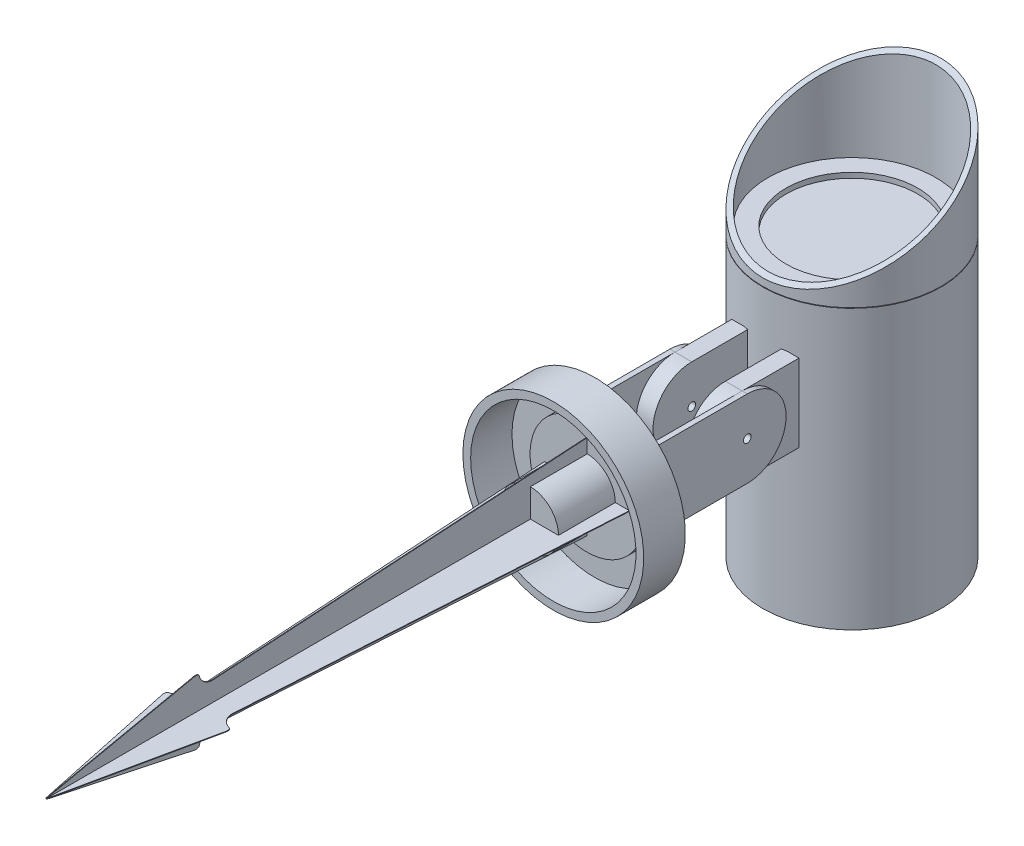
ISO-10303-21;
HEADER;
FILE_DESCRIPTION(('STEP AP214'),'2;1');
FILE_NAME('part.step','',(''),(''),'','','');
FILE_SCHEMA(('AUTOMOTIVE_DESIGN { 1 0 10303 214 1 1 1 1 }'));
ENDSEC;
DATA;
#1=APPLICATION_CONTEXT('core data for automotive mechanical design processes');
#2=APPLICATION_PROTOCOL_DEFINITION('international standard','automotive_design',2000,#1);
#3=PRODUCT_CONTEXT('',#1,'mechanical');
#4=PRODUCT('Part','Part','',(#3));
#5=PRODUCT_RELATED_PRODUCT_CATEGORY('part','',(#4));
#6=PRODUCT_DEFINITION_FORMATION('','',#4);
#7=PRODUCT_DEFINITION_CONTEXT('part definition',#1,'design');
#8=PRODUCT_DEFINITION('design','',#6,#7);
#9=PRODUCT_DEFINITION_SHAPE('','',#8);
#10=(LENGTH_UNIT() NAMED_UNIT(*) SI_UNIT(.MILLI.,.METRE.));
#11=(NAMED_UNIT(*) PLANE_ANGLE_UNIT() SI_UNIT($,.RADIAN.));
#12=(NAMED_UNIT(*) SI_UNIT($,.STERADIAN.) SOLID_ANGLE_UNIT());
#13=UNCERTAINTY_MEASURE_WITH_UNIT(LENGTH_MEASURE(1.E-05),#10,'distance_accuracy_value','');
#14=(GEOMETRIC_REPRESENTATION_CONTEXT(3) GLOBAL_UNCERTAINTY_ASSIGNED_CONTEXT((#13)) GLOBAL_UNIT_ASSIGNED_CONTEXT((#10,
#11,#12)) REPRESENTATION_CONTEXT('',''));
#15=CARTESIAN_POINT('',(0.,0.,0.));
#16=DIRECTION('',(0.,0.,1.));
#17=DIRECTION('',(1.,0.,0.));
#18=AXIS2_PLACEMENT_3D('',#15,#16,#17);
#19=CARTESIAN_POINT('',(0.,-75.,-99.6));
#20=DIRECTION('',(0.,1.,0.));
#21=DIRECTION('',(0.,0.,1.));
#22=AXIS2_PLACEMENT_3D('',#19,#20,#21);
#23=CYLINDRICAL_SURFACE('',#22,34.5);
#24=CARTESIAN_POINT('',(0.,-75.,-99.6));
#25=DIRECTION('',(0.,1.,0.));
#26=DIRECTION('',(0.,0.,1.));
#27=AXIS2_PLACEMENT_3D('',#24,#25,#26);
#28=CIRCLE('',#27,34.5);
#29=CARTESIAN_POINT('',(0.,-75.,-65.1));
#30=VERTEX_POINT('',#29);
#31=EDGE_CURVE('E406',#30,#30,#28,.T.);
#32=ORIENTED_EDGE('',*,*,#31,.T.);
#33=EDGE_LOOP('',(#32));
#34=FACE_BOUND('',#33,.T.);
#35=DIRECTION('',(0.,1.,0.));
#36=VECTOR('',#35,1.);
#37=CARTESIAN_POINT('',(6.5,-75.,-65.7178513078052));
#38=LINE('',#37,#36);
#39=CARTESIAN_POINT('',(6.5,-15.,-65.7178513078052));
#40=VERTEX_POINT('',#39);
#41=CARTESIAN_POINT('',(6.5,15.,-65.7178513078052));
#42=VERTEX_POINT('',#41);
#43=EDGE_CURVE('E11',#40,#42,#38,.T.);
#44=ORIENTED_EDGE('',*,*,#43,.T.);
#45=CARTESIAN_POINT('',(0.,15.,-99.6));
#46=DIRECTION('',(0.,1.,0.));
#47=DIRECTION('',(0.,0.,1.));
#48=AXIS2_PLACEMENT_3D('',#45,#46,#47);
#49=CIRCLE('',#48,34.5);
#50=CARTESIAN_POINT('',(8.24621125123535,15.,-66.1));
#51=VERTEX_POINT('',#50);
#52=EDGE_CURVE('E390',#42,#51,#49,.T.);
#53=ORIENTED_EDGE('',*,*,#52,.T.);
#54=DIRECTION('',(0.,1.,0.));
#55=VECTOR('',#54,1.);
#56=CARTESIAN_POINT('',(8.24621125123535,-75.,-66.1));
#57=LINE('',#56,#55);
#58=CARTESIAN_POINT('',(8.24621125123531,-15.,-66.1));
#59=VERTEX_POINT('',#58);
#60=EDGE_CURVE('E398',#51,#59,#57,.F.);
#61=ORIENTED_EDGE('',*,*,#60,.T.);
#62=CARTESIAN_POINT('',(0.,-15.,-99.6));
#63=DIRECTION('',(0.,-1.,0.));
#64=DIRECTION('',(0.,0.,-1.));
#65=AXIS2_PLACEMENT_3D('',#62,#63,#64);
#66=CIRCLE('',#65,34.5);
#67=EDGE_CURVE('E402',#59,#40,#66,.T.);
#68=ORIENTED_EDGE('',*,*,#67,.T.);
#69=EDGE_LOOP('',(#44,#53,#61,#68));
#70=FACE_BOUND('',#69,.T.);
#71=CARTESIAN_POINT('',(0.,-15.,-99.6));
#72=DIRECTION('',(0.,1.,0.));
#73=DIRECTION('',(0.,0.,1.));
#74=AXIS2_PLACEMENT_3D('',#71,#72,#73);
#75=CIRCLE('',#74,34.5);
#76=CARTESIAN_POINT('',(-8.24621125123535,-15.,-66.1));
#77=VERTEX_POINT('',#76);
#78=CARTESIAN_POINT('',(-6.5,-15.,-65.7178513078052));
#79=VERTEX_POINT('',#78);
#80=EDGE_CURVE('E423',#77,#79,#75,.T.);
#81=ORIENTED_EDGE('',*,*,#80,.F.);
#82=DIRECTION('',(0.,1.,0.));
#83=VECTOR('',#82,1.);
#84=CARTESIAN_POINT('',(-8.24621125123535,-75.,-66.1));
#85=LINE('',#84,#83);
#86=CARTESIAN_POINT('',(-8.24621125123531,15.,-66.1));
#87=VERTEX_POINT('',#86);
#88=EDGE_CURVE('E58',#87,#77,#85,.F.);
#89=ORIENTED_EDGE('',*,*,#88,.F.);
#90=CARTESIAN_POINT('',(0.,15.,-99.6));
#91=DIRECTION('',(0.,-1.,0.));
#92=DIRECTION('',(0.,0.,-1.));
#93=AXIS2_PLACEMENT_3D('',#90,#91,#92);
#94=CIRCLE('',#93,34.5);
#95=CARTESIAN_POINT('',(-6.5,15.,-65.7178513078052));
#96=VERTEX_POINT('',#95);
#97=EDGE_CURVE('E66',#96,#87,#94,.T.);
#98=ORIENTED_EDGE('',*,*,#97,.F.);
#99=DIRECTION('',(0.,1.,0.));
#100=VECTOR('',#99,1.);
#101=CARTESIAN_POINT('',(-6.5,-75.,-65.7178513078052));
#102=LINE('',#101,#100);
#103=EDGE_CURVE('E397',#96,#79,#102,.F.);
#104=ORIENTED_EDGE('',*,*,#103,.T.);
#105=EDGE_LOOP('',(#81,#89,#98,#104));
#106=FACE_BOUND('',#105,.T.);
#107=CARTESIAN_POINT('',(0.,32.8,-99.6));
#108=DIRECTION('',(0.,1.,0.));
#109=DIRECTION('',(0.,0.,1.));
#110=AXIS2_PLACEMENT_3D('',#107,#108,#109);
#111=CIRCLE('',#110,34.5);
#112=CARTESIAN_POINT('',(0.,32.8,-65.1));
#113=VERTEX_POINT('',#112);
#114=EDGE_CURVE('E1080',#113,#113,#111,.T.);
#115=ORIENTED_EDGE('',*,*,#114,.F.);
#116=EDGE_LOOP('',(#115));
#117=FACE_BOUND('',#116,.T.);
#118=ADVANCED_FACE('F41',(#34,#70,#106,#117),#23,.T.);
#119=CARTESIAN_POINT('',(-13.,0.,-44.1));
#120=DIRECTION('',(-1.,0.,0.));
#121=DIRECTION('',(0.,0.,1.));
#122=AXIS2_PLACEMENT_3D('',#119,#120,#121);
#123=PLANE('',#122);
#124=CARTESIAN_POINT('',(-13.,0.,-44.1));
#125=DIRECTION('',(1.,0.,0.));
#126=DIRECTION('',(0.,0.,-1.));
#127=AXIS2_PLACEMENT_3D('',#124,#125,#126);
#128=CIRCLE('',#127,15.);
#129=CARTESIAN_POINT('',(-13.,15.,-44.1));
#130=VERTEX_POINT('',#129);
#131=CARTESIAN_POINT('',(-13.,-15.,-44.1));
#132=VERTEX_POINT('',#131);
#133=EDGE_CURVE('E472',#130,#132,#128,.T.);
#134=ORIENTED_EDGE('',*,*,#133,.F.);
#135=DIRECTION('',(0.,0.,-1.));
#136=VECTOR('',#135,1.);
#137=CARTESIAN_POINT('',(-13.,15.,-2.1));
#138=LINE('',#137,#136);
#139=CARTESIAN_POINT('',(-13.,15.,-2.1));
#140=VERTEX_POINT('',#139);
#141=EDGE_CURVE('E545',#140,#130,#138,.T.);
#142=ORIENTED_EDGE('',*,*,#141,.F.);
#143=DIRECTION('',(0.,1.,0.));
#144=VECTOR('',#143,1.);
#145=CARTESIAN_POINT('',(-13.,15.,-2.1));
#146=LINE('',#145,#144);
#147=CARTESIAN_POINT('',(-13.,-15.,-2.1));
#148=VERTEX_POINT('',#147);
#149=EDGE_CURVE('E541',#148,#140,#146,.T.);
#150=ORIENTED_EDGE('',*,*,#149,.F.);
#151=DIRECTION('',(0.,0.,1.));
#152=VECTOR('',#151,1.);
#153=CARTESIAN_POINT('',(-13.,-15.,-2.1));
#154=LINE('',#153,#152);
#155=EDGE_CURVE('E553',#132,#148,#154,.T.);
#156=ORIENTED_EDGE('',*,*,#155,.F.);
#157=EDGE_LOOP('',(#134,#142,#150,#156));
#158=FACE_BOUND('',#157,.T.);
#159=ADVANCED_FACE('F1041',(#158),#123,.F.);
#160=CARTESIAN_POINT('',(0.,0.,-2.1));
#161=DIRECTION('',(0.,0.,1.));
#162=DIRECTION('',(1.,0.,0.));
#163=AXIS2_PLACEMENT_3D('',#160,#161,#162);
#164=PLANE('',#163);
#165=DIRECTION('',(0.,1.,0.));
#166=VECTOR('',#165,1.);
#167=CARTESIAN_POINT('',(13.,15.,-2.1));
#168=LINE('',#167,#166);
#169=CARTESIAN_POINT('',(13.,-15.,-2.1));
#170=VERTEX_POINT('',#169);
#171=CARTESIAN_POINT('',(13.,15.,-2.1));
#172=VERTEX_POINT('',#171);
#173=EDGE_CURVE('E513',#170,#172,#168,.T.);
#174=ORIENTED_EDGE('',*,*,#173,.F.);
#175=DIRECTION('',(-1.,0.,0.));
#176=VECTOR('',#175,1.);
#177=CARTESIAN_POINT('',(15.,-15.,-2.1));
#178=LINE('',#177,#176);
#179=EDGE_CURVE('E569',#170,#148,#178,.T.);
#180=ORIENTED_EDGE('',*,*,#179,.T.);
#181=ORIENTED_EDGE('',*,*,#149,.T.);
#182=DIRECTION('',(1.,0.,0.));
#183=VECTOR('',#182,1.);
#184=CARTESIAN_POINT('',(15.,15.,-2.1));
#185=LINE('',#184,#183);
#186=EDGE_CURVE('E572',#140,#172,#185,.T.);
#187=ORIENTED_EDGE('',*,*,#186,.T.);
#188=EDGE_LOOP('',(#174,#180,#181,#187));
#189=FACE_BOUND('',#188,.T.);
#190=ADVANCED_FACE('F1048',(#189),#164,.F.);
#191=CARTESIAN_POINT('',(0.,0.,0.));
#192=DIRECTION('',(0.,0.,-1.));
#193=DIRECTION('',(-1.,0.,0.));
#194=AXIS2_PLACEMENT_3D('',#191,#192,#193);
#195=PLANE('',#194);
#196=CARTESIAN_POINT('',(0.,0.,0.));
#197=DIRECTION('',(0.,0.,1.));
#198=DIRECTION('',(1.,0.,0.));
#199=AXIS2_PLACEMENT_3D('',#196,#197,#198);
#200=CIRCLE('',#199,22.);
#201=CARTESIAN_POINT('',(22.,0.,0.));
#202=VERTEX_POINT('',#201);
#203=EDGE_CURVE('E618',#202,#202,#200,.T.);
#204=ORIENTED_EDGE('',*,*,#203,.F.);
#205=EDGE_LOOP('',(#204));
#206=FACE_BOUND('',#205,.T.);
#207=CARTESIAN_POINT('',(0.,0.,0.));
#208=DIRECTION('',(0.,0.,-1.));
#209=DIRECTION('',(-1.,0.,0.));
#210=AXIS2_PLACEMENT_3D('',#207,#208,#209);
#211=CIRCLE('',#210,32.);
#212=CARTESIAN_POINT('',(-32.,0.,0.));
#213=VERTEX_POINT('',#212);
#214=EDGE_CURVE('E51',#213,#213,#211,.T.);
#215=ORIENTED_EDGE('',*,*,#214,.F.);
#216=EDGE_LOOP('',(#215));
#217=FACE_BOUND('',#216,.T.);
#218=ADVANCED_FACE('F1362',(#206,#217),#195,.F.);
#219=CARTESIAN_POINT('',(0.,0.,3.));
#220=DIRECTION('',(0.,0.,1.));
#221=DIRECTION('',(1.,0.,0.));
#222=AXIS2_PLACEMENT_3D('',#219,#220,#221);
#223=PLANE('',#222);
#224=CARTESIAN_POINT('',(0.,0.,3.));
#225=DIRECTION('',(0.,0.,1.));
#226=DIRECTION('',(1.,0.,0.));
#227=AXIS2_PLACEMENT_3D('',#224,#225,#226);
#228=CIRCLE('',#227,22.);
#229=CARTESIAN_POINT('',(22.,0.,3.));
#230=VERTEX_POINT('',#229);
#231=EDGE_CURVE('E992',#230,#230,#228,.T.);
#232=ORIENTED_EDGE('',*,*,#231,.T.);
#233=EDGE_LOOP('',(#232));
#234=FACE_BOUND('',#233,.T.);
#235=DIRECTION('',(-1.,0.,0.));
#236=VECTOR('',#235,1.);
#237=CARTESIAN_POINT('',(0.124999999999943,16.4383895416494,3.00000000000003));
#238=LINE('',#237,#236);
#239=CARTESIAN_POINT('',(0.124999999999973,16.4383895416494,3.));
#240=VERTEX_POINT('',#239);
#241=CARTESIAN_POINT('',(-0.125000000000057,16.4383895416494,3.));
#242=VERTEX_POINT('',#241);
#243=EDGE_CURVE('E765',#240,#242,#238,.T.);
#244=ORIENTED_EDGE('',*,*,#243,.F.);
#245=DIRECTION('',(0.,-1.,0.));
#246=VECTOR('',#245,1.);
#247=CARTESIAN_POINT('',(0.125000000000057,-16.4383895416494,3.00000000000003));
#248=LINE('',#247,#246);
#249=CARTESIAN_POINT('',(0.124999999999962,10.9992897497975,3.));
#250=VERTEX_POINT('',#249);
#251=EDGE_CURVE('E721',#240,#250,#248,.T.);
#252=ORIENTED_EDGE('',*,*,#251,.T.);
#253=CARTESIAN_POINT('',(0.,0.,3.));
#254=DIRECTION('',(0.,0.,1.));
#255=DIRECTION('',(1.,0.,0.));
#256=AXIS2_PLACEMENT_3D('',#253,#254,#255);
#257=CIRCLE('',#256,11.);
#258=CARTESIAN_POINT('',(10.9992897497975,0.125,3.));
#259=VERTEX_POINT('',#258);
#260=EDGE_CURVE('E995',#259,#250,#257,.T.);
#261=ORIENTED_EDGE('',*,*,#260,.F.);
#262=DIRECTION('',(-1.,0.,0.));
#263=VECTOR('',#262,1.);
#264=CARTESIAN_POINT('',(-16.4383895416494,0.125,3.00000000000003));
#265=LINE('',#264,#263);
#266=CARTESIAN_POINT('',(16.4383895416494,0.125,3.));
#267=VERTEX_POINT('',#266);
#268=EDGE_CURVE('E837',#267,#259,#265,.T.);
#269=ORIENTED_EDGE('',*,*,#268,.F.);
#270=DIRECTION('',(0.,1.,0.));
#271=VECTOR('',#270,1.);
#272=CARTESIAN_POINT('',(16.4383895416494,-0.125,3.00000000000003));
#273=LINE('',#272,#271);
#274=CARTESIAN_POINT('',(16.4383895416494,-0.125,3.));
#275=VERTEX_POINT('',#274);
#276=EDGE_CURVE('E934',#275,#267,#273,.T.);
#277=ORIENTED_EDGE('',*,*,#276,.F.);
#278=DIRECTION('',(-1.,0.,0.));
#279=VECTOR('',#278,1.);
#280=CARTESIAN_POINT('',(-16.4383895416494,-0.125,3.00000000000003));
#281=LINE('',#280,#279);
#282=CARTESIAN_POINT('',(10.9992897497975,-0.125,3.));
#283=VERTEX_POINT('',#282);
#284=EDGE_CURVE('E888',#275,#283,#281,.T.);
#285=ORIENTED_EDGE('',*,*,#284,.T.);
#286=CARTESIAN_POINT('',(0.125000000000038,-10.9992897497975,3.00000000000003));
#287=VERTEX_POINT('',#286);
#288=EDGE_CURVE('E1001',#287,#283,#257,.T.);
#289=ORIENTED_EDGE('',*,*,#288,.F.);
#290=CARTESIAN_POINT('',(0.125000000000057,-16.4383895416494,3.00000000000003));
#291=VERTEX_POINT('',#290);
#292=EDGE_CURVE('E720',#287,#291,#248,.T.);
#293=ORIENTED_EDGE('',*,*,#292,.T.);
#294=DIRECTION('',(-1.,0.,0.));
#295=VECTOR('',#294,1.);
#296=CARTESIAN_POINT('',(0.125000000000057,-16.4383895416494,3.00000000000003));
#297=LINE('',#296,#295);
#298=CARTESIAN_POINT('',(-0.124999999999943,-16.4383895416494,3.00000000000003));
#299=VERTEX_POINT('',#298);
#300=EDGE_CURVE('E798',#291,#299,#297,.T.);
#301=ORIENTED_EDGE('',*,*,#300,.T.);
#302=DIRECTION('',(0.,-1.,0.));
#303=VECTOR('',#302,1.);
#304=CARTESIAN_POINT('',(-0.124999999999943,-16.4383895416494,3.00000000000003));
#305=LINE('',#304,#303);
#306=CARTESIAN_POINT('',(-0.124999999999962,-10.9992897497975,3.00000000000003));
#307=VERTEX_POINT('',#306);
#308=EDGE_CURVE('E669',#307,#299,#305,.T.);
#309=ORIENTED_EDGE('',*,*,#308,.F.);
#310=CARTESIAN_POINT('',(-10.9992897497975,-0.125,3.));
#311=VERTEX_POINT('',#310);
#312=EDGE_CURVE('E1002',#311,#307,#257,.T.);
#313=ORIENTED_EDGE('',*,*,#312,.F.);
#314=CARTESIAN_POINT('',(-16.4383895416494,-0.125,3.));
#315=VERTEX_POINT('',#314);
#316=EDGE_CURVE('E887',#311,#315,#281,.T.);
#317=ORIENTED_EDGE('',*,*,#316,.T.);
#318=DIRECTION('',(0.,1.,0.));
#319=VECTOR('',#318,1.);
#320=CARTESIAN_POINT('',(-16.4383895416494,-0.125,3.00000000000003));
#321=LINE('',#320,#319);
#322=CARTESIAN_POINT('',(-16.4383895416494,0.125,3.));
#323=VERTEX_POINT('',#322);
#324=EDGE_CURVE('E967',#315,#323,#321,.T.);
#325=ORIENTED_EDGE('',*,*,#324,.T.);
#326=CARTESIAN_POINT('',(-10.9992897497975,0.125,3.));
#327=VERTEX_POINT('',#326);
#328=EDGE_CURVE('E836',#327,#323,#265,.T.);
#329=ORIENTED_EDGE('',*,*,#328,.F.);
#330=CARTESIAN_POINT('',(-0.125000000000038,10.9992897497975,3.));
#331=VERTEX_POINT('',#330);
#332=EDGE_CURVE('E1000',#331,#327,#257,.T.);
#333=ORIENTED_EDGE('',*,*,#332,.F.);
#334=EDGE_CURVE('E670',#242,#331,#305,.T.);
#335=ORIENTED_EDGE('',*,*,#334,.F.);
#336=EDGE_LOOP('',(#244,#252,#261,#269,#277,#285,#289,#293,#301,#309,#313,#317,#325,#329,#333,#335));
#337=FACE_BOUND('',#336,.T.);
#338=ADVANCED_FACE('F1414',(#234,#337),#223,.T.);
#339=CARTESIAN_POINT('',(0.,0.,25.));
#340=DIRECTION('',(0.,0.,-1.));
#341=DIRECTION('',(-1.,0.,0.));
#342=AXIS2_PLACEMENT_3D('',#339,#340,#341);
#343=CYLINDRICAL_SURFACE('',#342,11.);
#344=DIRECTION('',(0.,0.,-1.));
#345=VECTOR('',#344,1.);
#346=CARTESIAN_POINT('',(0.125000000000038,-10.9992897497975,25.));
#347=LINE('',#346,#345);
#348=CARTESIAN_POINT('',(0.125000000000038,-10.9992897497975,25.));
#349=VERTEX_POINT('',#348);
#350=EDGE_CURVE('E829',#287,#349,#347,.F.);
#351=ORIENTED_EDGE('',*,*,#350,.F.);
#352=ORIENTED_EDGE('',*,*,#288,.T.);
#353=DIRECTION('',(0.,0.,-1.));
#354=VECTOR('',#353,1.);
#355=CARTESIAN_POINT('',(10.9992897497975,-0.125,25.));
#356=LINE('',#355,#354);
#357=CARTESIAN_POINT('',(10.9992897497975,-0.125,25.));
#358=VERTEX_POINT('',#357);
#359=EDGE_CURVE('E983',#358,#283,#356,.T.);
#360=ORIENTED_EDGE('',*,*,#359,.F.);
#361=CARTESIAN_POINT('',(0.,0.,25.));
#362=DIRECTION('',(0.,0.,1.));
#363=DIRECTION('',(1.,0.,0.));
#364=AXIS2_PLACEMENT_3D('',#361,#362,#363);
#365=CIRCLE('',#364,11.);
#366=EDGE_CURVE('E987',#349,#358,#365,.T.);
#367=ORIENTED_EDGE('',*,*,#366,.F.);
#368=EDGE_LOOP('',(#351,#352,#360,#367));
#369=FACE_BOUND('',#368,.T.);
#370=ADVANCED_FACE('F1705',(#369),#343,.T.);
#371=CARTESIAN_POINT('',(0.,0.,25.));
#372=DIRECTION('',(0.,0.,1.));
#373=DIRECTION('',(1.,0.,0.));
#374=AXIS2_PLACEMENT_3D('',#371,#372,#373);
#375=PLANE('',#374);
#376=DIRECTION('',(-1.,0.,0.));
#377=VECTOR('',#376,1.);
#378=CARTESIAN_POINT('',(0.,-0.125,25.));
#379=LINE('',#378,#377);
#380=CARTESIAN_POINT('',(0.125,-0.125,25.));
#381=VERTEX_POINT('',#380);
#382=EDGE_CURVE('E1014',#358,#381,#379,.T.);
#383=ORIENTED_EDGE('',*,*,#382,.T.);
#384=DIRECTION('',(0.,-1.,0.));
#385=VECTOR('',#384,1.);
#386=CARTESIAN_POINT('',(0.125,0.,25.));
#387=LINE('',#386,#385);
#388=EDGE_CURVE('E825',#381,#349,#387,.T.);
#389=ORIENTED_EDGE('',*,*,#388,.T.);
#390=ORIENTED_EDGE('',*,*,#366,.T.);
#391=EDGE_LOOP('',(#383,#389,#390));
#392=FACE_BOUND('',#391,.T.);
#393=ADVANCED_FACE('F1693',(#392),#375,.T.);
#394=DIRECTION('',(0.,0.,-1.));
#395=VECTOR('',#394,1.);
#396=CARTESIAN_POINT('',(0.124999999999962,10.9992897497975,25.));
#397=LINE('',#396,#395);
#398=CARTESIAN_POINT('',(0.124999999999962,10.9992897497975,25.));
#399=VERTEX_POINT('',#398);
#400=EDGE_CURVE('E814',#399,#250,#397,.T.);
#401=ORIENTED_EDGE('',*,*,#400,.F.);
#402=CARTESIAN_POINT('',(10.9992897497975,0.125,25.));
#403=VERTEX_POINT('',#402);
#404=EDGE_CURVE('E988',#403,#399,#365,.T.);
#405=ORIENTED_EDGE('',*,*,#404,.F.);
#406=DIRECTION('',(0.,0.,-1.));
#407=VECTOR('',#406,1.);
#408=CARTESIAN_POINT('',(10.9992897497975,0.125,25.));
#409=LINE('',#408,#407);
#410=EDGE_CURVE('E976',#403,#259,#409,.T.);
#411=ORIENTED_EDGE('',*,*,#410,.T.);
#412=ORIENTED_EDGE('',*,*,#260,.T.);
#413=EDGE_LOOP('',(#401,#405,#411,#412));
#414=FACE_BOUND('',#413,.T.);
#415=ADVANCED_FACE('F1724',(#414),#343,.T.);
#416=ORIENTED_EDGE('',*,*,#404,.T.);
#417=DIRECTION('',(0.,-1.,0.));
#418=VECTOR('',#417,1.);
#419=CARTESIAN_POINT('',(0.125,0.,25.));
#420=LINE('',#419,#418);
#421=CARTESIAN_POINT('',(0.125,0.125,25.));
#422=VERTEX_POINT('',#421);
#423=EDGE_CURVE('E811',#399,#422,#420,.T.);
#424=ORIENTED_EDGE('',*,*,#423,.T.);
#425=DIRECTION('',(-1.,0.,0.));
#426=VECTOR('',#425,1.);
#427=CARTESIAN_POINT('',(0.,0.125,25.));
#428=LINE('',#427,#426);
#429=EDGE_CURVE('E1009',#403,#422,#428,.T.);
#430=ORIENTED_EDGE('',*,*,#429,.F.);
#431=EDGE_LOOP('',(#416,#424,#430));
#432=FACE_BOUND('',#431,.T.);
#433=ADVANCED_FACE('F1716',(#432),#375,.T.);
#434=CARTESIAN_POINT('',(-12.9941346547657,-0.125,147.998401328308));
#435=DIRECTION('',(0.,1.,0.));
#436=DIRECTION('',(0.,0.,1.));
#437=AXIS2_PLACEMENT_3D('',#434,#435,#436);
#438=PLANE('',#437);
#439=DIRECTION('',(0.,0.,1.));
#440=VECTOR('',#439,1.);
#441=CARTESIAN_POINT('',(0.125,-0.125,147.998401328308));
#442=LINE('',#441,#440);
#443=CARTESIAN_POINT('',(0.125,-0.125000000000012,212.193352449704));
#444=VERTEX_POINT('',#443);
#445=EDGE_CURVE('E654',#381,#444,#442,.T.);
#446=ORIENTED_EDGE('',*,*,#445,.F.);
#447=ORIENTED_EDGE('',*,*,#382,.F.);
#448=ORIENTED_EDGE('',*,*,#359,.T.);
#449=ORIENTED_EDGE('',*,*,#284,.F.);
#450=DIRECTION('',(0.0604991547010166,0.,-0.998168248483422));
#451=VECTOR('',#450,1.);
#452=CARTESIAN_POINT('',(7.65001070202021,-0.125,147.998401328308));
#453=LINE('',#452,#451);
#454=CARTESIAN_POINT('',(7.65001070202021,-0.125,147.998401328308));
#455=VERTEX_POINT('',#454);
#456=EDGE_CURVE('E883',#455,#275,#453,.T.);
#457=ORIENTED_EDGE('',*,*,#456,.F.);
#458=CARTESIAN_POINT('',(12.9941346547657,-0.125,147.998401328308));
#459=DIRECTION('',(0.,-1.,0.));
#460=DIRECTION('',(0.,0.,-1.));
#461=AXIS2_PLACEMENT_3D('',#458,#459,#460);
#462=CIRCLE('',#461,5.3441239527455);
#463=CARTESIAN_POINT('',(11.610998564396,-0.125,153.160435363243));
#464=VERTEX_POINT('',#463);
#465=EDGE_CURVE('E930',#464,#455,#462,.T.);
#466=ORIENTED_EDGE('',*,*,#465,.F.);
#467=CARTESIAN_POINT('',(11.3521841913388,-0.125,154.126362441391));
#468=DIRECTION('',(0.,1.,0.));
#469=DIRECTION('',(0.,0.,-1.));
#470=AXIS2_PLACEMENT_3D('',#467,#468,#469);
#471=CIRCLE('',#470,1.00000000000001);
#472=CARTESIAN_POINT('',(12.342048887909,-0.125,153.98434877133));
#473=VERTEX_POINT('',#472);
#474=EDGE_CURVE('E926',#473,#464,#471,.T.);
#475=ORIENTED_EDGE('',*,*,#474,.F.);
#476=CARTESIAN_POINT('',(8.69217596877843,-0.125,154.50798786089));
#477=DIRECTION('',(0.,1.,0.));
#478=DIRECTION('',(0.,0.,-1.));
#479=AXIS2_PLACEMENT_3D('',#476,#477,#478);
#480=CIRCLE('',#479,3.68724425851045);
#481=CARTESIAN_POINT('',(12.1495810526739,-0.125,155.78944028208));
#482=VERTEX_POINT('',#481);
#483=EDGE_CURVE('E922',#482,#473,#480,.T.);
#484=ORIENTED_EDGE('',*,*,#483,.F.);
#485=DIRECTION('',(0.207733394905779,0.,-0.978185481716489));
#486=VECTOR('',#485,1.);
#487=CARTESIAN_POINT('',(0.195637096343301,-0.125,212.078774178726));
#488=LINE('',#487,#486);
#489=CARTESIAN_POINT('',(0.195637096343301,-0.125,212.078774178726));
#490=VERTEX_POINT('',#489);
#491=EDGE_CURVE('E917',#490,#482,#488,.T.);
#492=ORIENTED_EDGE('',*,*,#491,.F.);
#493=CARTESIAN_POINT('',(0.,-0.125,212.037227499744));
#494=DIRECTION('',(0.,1.,0.));
#495=DIRECTION('',(0.,0.,-1.));
#496=AXIS2_PLACEMENT_3D('',#493,#494,#495);
#497=CIRCLE('',#496,0.200000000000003);
#498=EDGE_CURVE('E912',#444,#490,#497,.T.);
#499=ORIENTED_EDGE('',*,*,#498,.F.);
#500=EDGE_LOOP('',(#446,#447,#448,#449,#457,#466,#475,#484,#492,#499));
#501=FACE_BOUND('',#500,.T.);
#502=ADVANCED_FACE('F1633',(#501),#438,.F.);
#503=CARTESIAN_POINT('',(-12.9941346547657,0.125,147.998401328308));
#504=DIRECTION('',(0.,1.,0.));
#505=DIRECTION('',(0.,0.,1.));
#506=AXIS2_PLACEMENT_3D('',#503,#504,#505);
#507=PLANE('',#506);
#508=ORIENTED_EDGE('',*,*,#429,.T.);
#509=DIRECTION('',(0.,0.,1.));
#510=VECTOR('',#509,1.);
#511=CARTESIAN_POINT('',(0.124999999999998,0.125,147.998401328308));
#512=LINE('',#511,#510);
#513=CARTESIAN_POINT('',(0.125000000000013,0.125,212.193352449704));
#514=VERTEX_POINT('',#513);
#515=EDGE_CURVE('E623',#422,#514,#512,.T.);
#516=ORIENTED_EDGE('',*,*,#515,.T.);
#517=CARTESIAN_POINT('',(0.,0.125,212.037227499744));
#518=DIRECTION('',(0.,1.,0.));
#519=DIRECTION('',(0.,0.,-1.));
#520=AXIS2_PLACEMENT_3D('',#517,#518,#519);
#521=CIRCLE('',#520,0.200000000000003);
#522=CARTESIAN_POINT('',(0.195637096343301,0.125,212.078774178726));
#523=VERTEX_POINT('',#522);
#524=EDGE_CURVE('E861',#514,#523,#521,.T.);
#525=ORIENTED_EDGE('',*,*,#524,.T.);
#526=DIRECTION('',(0.207733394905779,0.,-0.978185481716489));
#527=VECTOR('',#526,1.);
#528=CARTESIAN_POINT('',(0.195637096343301,0.125,212.078774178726));
#529=LINE('',#528,#527);
#530=CARTESIAN_POINT('',(12.1495810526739,0.125,155.78944028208));
#531=VERTEX_POINT('',#530);
#532=EDGE_CURVE('E866',#523,#531,#529,.T.);
#533=ORIENTED_EDGE('',*,*,#532,.T.);
#534=CARTESIAN_POINT('',(8.69217596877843,0.125,154.50798786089));
#535=DIRECTION('',(0.,1.,0.));
#536=DIRECTION('',(0.,0.,-1.));
#537=AXIS2_PLACEMENT_3D('',#534,#535,#536);
#538=CIRCLE('',#537,3.68724425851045);
#539=CARTESIAN_POINT('',(12.342048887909,0.125,153.98434877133));
#540=VERTEX_POINT('',#539);
#541=EDGE_CURVE('E871',#531,#540,#538,.T.);
#542=ORIENTED_EDGE('',*,*,#541,.T.);
#543=CARTESIAN_POINT('',(11.3521841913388,0.125,154.126362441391));
#544=DIRECTION('',(0.,1.,0.));
#545=DIRECTION('',(0.,0.,-1.));
#546=AXIS2_PLACEMENT_3D('',#543,#544,#545);
#547=CIRCLE('',#546,1.00000000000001);
#548=CARTESIAN_POINT('',(11.610998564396,0.125,153.160435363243));
#549=VERTEX_POINT('',#548);
#550=EDGE_CURVE('E875',#540,#549,#547,.T.);
#551=ORIENTED_EDGE('',*,*,#550,.T.);
#552=CARTESIAN_POINT('',(12.9941346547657,0.125,147.998401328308));
#553=DIRECTION('',(0.,-1.,0.));
#554=DIRECTION('',(0.,0.,-1.));
#555=AXIS2_PLACEMENT_3D('',#552,#553,#554);
#556=CIRCLE('',#555,5.3441239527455);
#557=CARTESIAN_POINT('',(7.65001070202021,0.125,147.998401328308));
#558=VERTEX_POINT('',#557);
#559=EDGE_CURVE('E879',#549,#558,#556,.T.);
#560=ORIENTED_EDGE('',*,*,#559,.T.);
#561=DIRECTION('',(0.0604991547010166,0.,-0.998168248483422));
#562=VECTOR('',#561,1.);
#563=CARTESIAN_POINT('',(7.65001070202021,0.125,147.998401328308));
#564=LINE('',#563,#562);
#565=EDGE_CURVE('E832',#558,#267,#564,.T.);
#566=ORIENTED_EDGE('',*,*,#565,.T.);
#567=ORIENTED_EDGE('',*,*,#268,.T.);
#568=ORIENTED_EDGE('',*,*,#410,.F.);
#569=EDGE_LOOP('',(#508,#516,#525,#533,#542,#551,#560,#566,#567,#568));
#570=FACE_BOUND('',#569,.T.);
#571=ADVANCED_FACE('F1605',(#570),#507,.T.);
#572=CARTESIAN_POINT('',(0.,-0.125,212.037227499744));
#573=DIRECTION('',(0.,1.,0.));
#574=DIRECTION('',(0.,0.,1.));
#575=AXIS2_PLACEMENT_3D('',#572,#573,#574);
#576=CYLINDRICAL_SURFACE('',#575,0.200000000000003);
#577=DIRECTION('',(0.,-1.,0.));
#578=VECTOR('',#577,1.);
#579=CARTESIAN_POINT('',(-0.125000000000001,0.124999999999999,212.193352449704));
#580=LINE('',#579,#578);
#581=CARTESIAN_POINT('',(-0.125000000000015,-0.125,212.193352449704));
#582=VERTEX_POINT('',#581);
#583=CARTESIAN_POINT('',(-0.125,0.125,212.193352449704));
#584=VERTEX_POINT('',#583);
#585=EDGE_CURVE('E626',#582,#584,#580,.F.);
#586=ORIENTED_EDGE('',*,*,#585,.T.);
#587=CARTESIAN_POINT('',(-0.195637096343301,0.125,212.078774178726));
#588=VERTEX_POINT('',#587);
#589=EDGE_CURVE('E862',#588,#584,#521,.T.);
#590=ORIENTED_EDGE('',*,*,#589,.F.);
#591=DIRECTION('',(0.,1.,0.));
#592=VECTOR('',#591,1.);
#593=CARTESIAN_POINT('',(-0.195637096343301,-0.125,212.078774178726));
#594=LINE('',#593,#592);
#595=CARTESIAN_POINT('',(-0.195637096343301,-0.125,212.078774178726));
#596=VERTEX_POINT('',#595);
#597=EDGE_CURVE('E952',#596,#588,#594,.T.);
#598=ORIENTED_EDGE('',*,*,#597,.F.);
#599=EDGE_CURVE('E913',#596,#582,#497,.T.);
#600=ORIENTED_EDGE('',*,*,#599,.T.);
#601=EDGE_LOOP('',(#586,#590,#598,#600));
#602=FACE_BOUND('',#601,.T.);
#603=ADVANCED_FACE('F1618',(#602),#576,.T.);
#604=ORIENTED_EDGE('',*,*,#524,.F.);
#605=DIRECTION('',(0.,-1.,0.));
#606=VECTOR('',#605,1.);
#607=CARTESIAN_POINT('',(0.124999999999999,0.125000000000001,212.193352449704));
#608=LINE('',#607,#606);
#609=EDGE_CURVE('E619',#444,#514,#608,.F.);
#610=ORIENTED_EDGE('',*,*,#609,.F.);
#611=ORIENTED_EDGE('',*,*,#498,.T.);
#612=DIRECTION('',(0.,1.,0.));
#613=VECTOR('',#612,1.);
#614=CARTESIAN_POINT('',(0.195637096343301,-0.125,212.078774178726));
#615=LINE('',#614,#613);
#616=EDGE_CURVE('E948',#490,#523,#615,.T.);
#617=ORIENTED_EDGE('',*,*,#616,.T.);
#618=EDGE_LOOP('',(#604,#610,#611,#617));
#619=FACE_BOUND('',#618,.T.);
#620=ADVANCED_FACE('F1619',(#619),#576,.T.);
#621=ORIENTED_EDGE('',*,*,#312,.T.);
#622=DIRECTION('',(0.,0.,-1.));
#623=VECTOR('',#622,1.);
#624=CARTESIAN_POINT('',(-0.124999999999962,-10.9992897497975,25.));
#625=LINE('',#624,#623);
#626=CARTESIAN_POINT('',(-0.124999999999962,-10.9992897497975,25.));
#627=VERTEX_POINT('',#626);
#628=EDGE_CURVE('E821',#307,#627,#625,.F.);
#629=ORIENTED_EDGE('',*,*,#628,.T.);
#630=CARTESIAN_POINT('',(-10.9992897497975,-0.125,25.));
#631=VERTEX_POINT('',#630);
#632=EDGE_CURVE('E994',#631,#627,#365,.T.);
#633=ORIENTED_EDGE('',*,*,#632,.F.);
#634=DIRECTION('',(0.,0.,-1.));
#635=VECTOR('',#634,1.);
#636=CARTESIAN_POINT('',(-10.9992897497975,-0.125,25.));
#637=LINE('',#636,#635);
#638=EDGE_CURVE('E979',#311,#631,#637,.F.);
#639=ORIENTED_EDGE('',*,*,#638,.F.);
#640=EDGE_LOOP('',(#621,#629,#633,#639));
#641=FACE_BOUND('',#640,.T.);
#642=ADVANCED_FACE('F1706',(#641),#343,.T.);
#643=DIRECTION('',(0.,-1.,0.));
#644=VECTOR('',#643,1.);
#645=CARTESIAN_POINT('',(-0.125,0.,25.));
#646=LINE('',#645,#644);
#647=CARTESIAN_POINT('',(-0.124999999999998,-0.125,25.));
#648=VERTEX_POINT('',#647);
#649=EDGE_CURVE('E818',#648,#627,#646,.T.);
#650=ORIENTED_EDGE('',*,*,#649,.F.);
#651=EDGE_CURVE('E1013',#648,#631,#379,.T.);
#652=ORIENTED_EDGE('',*,*,#651,.T.);
#653=ORIENTED_EDGE('',*,*,#632,.T.);
#654=EDGE_LOOP('',(#650,#652,#653));
#655=FACE_BOUND('',#654,.T.);
#656=ADVANCED_FACE('F1694',(#655),#375,.T.);
#657=CARTESIAN_POINT('',(0.,0.,3.));
#658=DIRECTION('',(0.,0.,-1.));
#659=DIRECTION('',(-1.,0.,0.));
#660=AXIS2_PLACEMENT_3D('',#657,#658,#659);
#661=CYLINDRICAL_SURFACE('',#660,22.);
#662=ORIENTED_EDGE('',*,*,#231,.F.);
#663=EDGE_LOOP('',(#662));
#664=FACE_BOUND('',#663,.T.);
#665=ORIENTED_EDGE('',*,*,#203,.T.);
#666=EDGE_LOOP('',(#665));
#667=FACE_BOUND('',#666,.T.);
#668=ADVANCED_FACE('F43',(#664,#667),#661,.T.);
#669=CARTESIAN_POINT('',(-0.125000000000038,10.9992897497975,25.));
#670=VERTEX_POINT('',#669);
#671=CARTESIAN_POINT('',(-10.9992897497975,0.125,25.));
#672=VERTEX_POINT('',#671);
#673=EDGE_CURVE('E993',#670,#672,#365,.T.);
#674=ORIENTED_EDGE('',*,*,#673,.F.);
#675=DIRECTION('',(0.,0.,-1.));
#676=VECTOR('',#675,1.);
#677=CARTESIAN_POINT('',(-0.125000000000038,10.9992897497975,25.));
#678=LINE('',#677,#676);
#679=EDGE_CURVE('E808',#670,#331,#678,.T.);
#680=ORIENTED_EDGE('',*,*,#679,.T.);
#681=ORIENTED_EDGE('',*,*,#332,.T.);
#682=DIRECTION('',(0.,0.,-1.));
#683=VECTOR('',#682,1.);
#684=CARTESIAN_POINT('',(-10.9992897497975,0.125,25.));
#685=LINE('',#684,#683);
#686=EDGE_CURVE('E938',#327,#672,#685,.F.);
#687=ORIENTED_EDGE('',*,*,#686,.T.);
#688=EDGE_LOOP('',(#674,#680,#681,#687));
#689=FACE_BOUND('',#688,.T.);
#690=ADVANCED_FACE('F1690',(#689),#343,.T.);
#691=DIRECTION('',(0.,-1.,0.));
#692=VECTOR('',#691,1.);
#693=CARTESIAN_POINT('',(-0.125,0.,25.));
#694=LINE('',#693,#692);
#695=CARTESIAN_POINT('',(-0.125,0.125,25.));
#696=VERTEX_POINT('',#695);
#697=EDGE_CURVE('E769',#670,#696,#694,.T.);
#698=ORIENTED_EDGE('',*,*,#697,.F.);
#699=ORIENTED_EDGE('',*,*,#673,.T.);
#700=EDGE_CURVE('E999',#696,#672,#428,.T.);
#701=ORIENTED_EDGE('',*,*,#700,.F.);
#702=EDGE_LOOP('',(#698,#699,#701));
#703=FACE_BOUND('',#702,.T.);
#704=ADVANCED_FACE('F1680',(#703),#375,.T.);
#705=ORIENTED_EDGE('',*,*,#651,.F.);
#706=DIRECTION('',(0.,0.,1.));
#707=VECTOR('',#706,1.);
#708=CARTESIAN_POINT('',(-0.124999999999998,-0.125,147.998401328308));
#709=LINE('',#708,#707);
#710=EDGE_CURVE('E661',#648,#582,#709,.T.);
#711=ORIENTED_EDGE('',*,*,#710,.T.);
#712=ORIENTED_EDGE('',*,*,#599,.F.);
#713=DIRECTION('',(0.207733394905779,0.,0.978185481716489));
#714=VECTOR('',#713,1.);
#715=CARTESIAN_POINT('',(-0.195637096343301,-0.125,212.078774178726));
#716=LINE('',#715,#714);
#717=CARTESIAN_POINT('',(-12.1495810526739,-0.125,155.78944028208));
#718=VERTEX_POINT('',#717);
#719=EDGE_CURVE('E908',#718,#596,#716,.T.);
#720=ORIENTED_EDGE('',*,*,#719,.F.);
#721=CARTESIAN_POINT('',(-8.69217596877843,-0.125,154.50798786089));
#722=DIRECTION('',(0.,1.,0.));
#723=DIRECTION('',(0.,0.,1.));
#724=AXIS2_PLACEMENT_3D('',#721,#722,#723);
#725=CIRCLE('',#724,3.68724425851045);
#726=CARTESIAN_POINT('',(-12.342048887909,-0.125,153.98434877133));
#727=VERTEX_POINT('',#726);
#728=EDGE_CURVE('E904',#727,#718,#725,.T.);
#729=ORIENTED_EDGE('',*,*,#728,.F.);
#730=CARTESIAN_POINT('',(-11.3521841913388,-0.125,154.126362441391));
#731=DIRECTION('',(0.,1.,0.));
#732=DIRECTION('',(0.,0.,1.));
#733=AXIS2_PLACEMENT_3D('',#730,#731,#732);
#734=CIRCLE('',#733,1.00000000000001);
#735=CARTESIAN_POINT('',(-11.610998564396,-0.125,153.160435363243));
#736=VERTEX_POINT('',#735);
#737=EDGE_CURVE('E900',#736,#727,#734,.T.);
#738=ORIENTED_EDGE('',*,*,#737,.F.);
#739=CARTESIAN_POINT('',(-12.9941346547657,-0.125,147.998401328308));
#740=DIRECTION('',(0.,-1.,0.));
#741=DIRECTION('',(0.,0.,1.));
#742=AXIS2_PLACEMENT_3D('',#739,#740,#741);
#743=CIRCLE('',#742,5.3441239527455);
#744=CARTESIAN_POINT('',(-7.65001070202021,-0.125,147.998401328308));
#745=VERTEX_POINT('',#744);
#746=EDGE_CURVE('E896',#745,#736,#743,.T.);
#747=ORIENTED_EDGE('',*,*,#746,.F.);
#748=DIRECTION('',(0.0604991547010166,0.,0.998168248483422));
#749=VECTOR('',#748,1.);
#750=CARTESIAN_POINT('',(-16.4383895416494,-0.125,3.00000000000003));
#751=LINE('',#750,#749);
#752=EDGE_CURVE('E892',#315,#745,#751,.T.);
#753=ORIENTED_EDGE('',*,*,#752,.F.);
#754=ORIENTED_EDGE('',*,*,#316,.F.);
#755=ORIENTED_EDGE('',*,*,#638,.T.);
#756=EDGE_LOOP('',(#705,#711,#712,#720,#729,#738,#747,#753,#754,#755));
#757=FACE_BOUND('',#756,.T.);
#758=ADVANCED_FACE('F1632',(#757),#438,.F.);
#759=DIRECTION('',(0.,0.,1.));
#760=VECTOR('',#759,1.);
#761=CARTESIAN_POINT('',(-0.125,0.125,147.998401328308));
#762=LINE('',#761,#760);
#763=EDGE_CURVE('E630',#696,#584,#762,.T.);
#764=ORIENTED_EDGE('',*,*,#763,.F.);
#765=ORIENTED_EDGE('',*,*,#700,.T.);
#766=ORIENTED_EDGE('',*,*,#686,.F.);
#767=ORIENTED_EDGE('',*,*,#328,.T.);
#768=DIRECTION('',(0.0604991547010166,0.,0.998168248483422));
#769=VECTOR('',#768,1.);
#770=CARTESIAN_POINT('',(-16.4383895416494,0.125,3.00000000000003));
#771=LINE('',#770,#769);
#772=CARTESIAN_POINT('',(-7.65001070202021,0.125,147.998401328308));
#773=VERTEX_POINT('',#772);
#774=EDGE_CURVE('E841',#323,#773,#771,.T.);
#775=ORIENTED_EDGE('',*,*,#774,.T.);
#776=CARTESIAN_POINT('',(-12.9941346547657,0.125,147.998401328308));
#777=DIRECTION('',(0.,-1.,0.));
#778=DIRECTION('',(0.,0.,1.));
#779=AXIS2_PLACEMENT_3D('',#776,#777,#778);
#780=CIRCLE('',#779,5.3441239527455);
#781=CARTESIAN_POINT('',(-11.610998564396,0.125,153.160435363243));
#782=VERTEX_POINT('',#781);
#783=EDGE_CURVE('E845',#773,#782,#780,.T.);
#784=ORIENTED_EDGE('',*,*,#783,.T.);
#785=CARTESIAN_POINT('',(-11.3521841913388,0.125,154.126362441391));
#786=DIRECTION('',(0.,1.,0.));
#787=DIRECTION('',(0.,0.,1.));
#788=AXIS2_PLACEMENT_3D('',#785,#786,#787);
#789=CIRCLE('',#788,1.00000000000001);
#790=CARTESIAN_POINT('',(-12.342048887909,0.125,153.98434877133));
#791=VERTEX_POINT('',#790);
#792=EDGE_CURVE('E849',#782,#791,#789,.T.);
#793=ORIENTED_EDGE('',*,*,#792,.T.);
#794=CARTESIAN_POINT('',(-8.69217596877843,0.125,154.50798786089));
#795=DIRECTION('',(0.,1.,0.));
#796=DIRECTION('',(0.,0.,1.));
#797=AXIS2_PLACEMENT_3D('',#794,#795,#796);
#798=CIRCLE('',#797,3.68724425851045);
#799=CARTESIAN_POINT('',(-12.1495810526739,0.125,155.78944028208));
#800=VERTEX_POINT('',#799);
#801=EDGE_CURVE('E853',#791,#800,#798,.T.);
#802=ORIENTED_EDGE('',*,*,#801,.T.);
#803=DIRECTION('',(0.207733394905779,0.,0.978185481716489));
#804=VECTOR('',#803,1.);
#805=CARTESIAN_POINT('',(-0.195637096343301,0.125,212.078774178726));
#806=LINE('',#805,#804);
#807=EDGE_CURVE('E857',#800,#588,#806,.T.);
#808=ORIENTED_EDGE('',*,*,#807,.T.);
#809=ORIENTED_EDGE('',*,*,#589,.T.);
#810=EDGE_LOOP('',(#764,#765,#766,#767,#775,#784,#793,#802,#808,#809));
#811=FACE_BOUND('',#810,.T.);
#812=ADVANCED_FACE('F1604',(#811),#507,.T.);
#813=CARTESIAN_POINT('',(7.65001070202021,-0.125,147.998401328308));
#814=DIRECTION('',(0.998168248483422,0.,0.0604991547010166));
#815=DIRECTION('',(0.0604991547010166,0.,-0.998168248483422));
#816=AXIS2_PLACEMENT_3D('',#813,#814,#815);
#817=PLANE('',#816);
#818=ORIENTED_EDGE('',*,*,#276,.T.);
#819=ORIENTED_EDGE('',*,*,#565,.F.);
#820=DIRECTION('',(0.,1.,0.));
#821=VECTOR('',#820,1.);
#822=CARTESIAN_POINT('',(7.65001070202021,-0.125,147.998401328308));
#823=LINE('',#822,#821);
#824=EDGE_CURVE('E935',#455,#558,#823,.T.);
#825=ORIENTED_EDGE('',*,*,#824,.F.);
#826=ORIENTED_EDGE('',*,*,#456,.T.);
#827=EDGE_LOOP('',(#818,#819,#825,#826));
#828=FACE_BOUND('',#827,.T.);
#829=ADVANCED_FACE('F1669',(#828),#817,.T.);
#830=CARTESIAN_POINT('',(12.9941346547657,-0.125,147.998401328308));
#831=DIRECTION('',(0.,1.,0.));
#832=DIRECTION('',(0.,0.,1.));
#833=AXIS2_PLACEMENT_3D('',#830,#831,#832);
#834=CYLINDRICAL_SURFACE('',#833,5.3441239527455);
#835=ORIENTED_EDGE('',*,*,#824,.T.);
#836=ORIENTED_EDGE('',*,*,#559,.F.);
#837=DIRECTION('',(0.,1.,0.));
#838=VECTOR('',#837,1.);
#839=CARTESIAN_POINT('',(11.610998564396,-0.125,153.160435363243));
#840=LINE('',#839,#838);
#841=EDGE_CURVE('E939',#464,#549,#840,.T.);
#842=ORIENTED_EDGE('',*,*,#841,.F.);
#843=ORIENTED_EDGE('',*,*,#465,.T.);
#844=EDGE_LOOP('',(#835,#836,#842,#843));
#845=FACE_BOUND('',#844,.T.);
#846=ADVANCED_FACE('F1865',(#845),#834,.F.);
#847=CARTESIAN_POINT('',(11.3521841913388,-0.125,154.126362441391));
#848=DIRECTION('',(0.,1.,0.));
#849=DIRECTION('',(0.,0.,1.));
#850=AXIS2_PLACEMENT_3D('',#847,#848,#849);
#851=CYLINDRICAL_SURFACE('',#850,1.00000000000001);
#852=ORIENTED_EDGE('',*,*,#841,.T.);
#853=ORIENTED_EDGE('',*,*,#550,.F.);
#854=DIRECTION('',(0.,1.,0.));
#855=VECTOR('',#854,1.);
#856=CARTESIAN_POINT('',(12.342048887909,-0.125,153.98434877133));
#857=LINE('',#856,#855);
#858=EDGE_CURVE('E942',#473,#540,#857,.T.);
#859=ORIENTED_EDGE('',*,*,#858,.F.);
#860=ORIENTED_EDGE('',*,*,#474,.T.);
#861=EDGE_LOOP('',(#852,#853,#859,#860));
#862=FACE_BOUND('',#861,.T.);
#863=ADVANCED_FACE('F1855',(#862),#851,.T.);
#864=CARTESIAN_POINT('',(8.69217596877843,-0.125,154.50798786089));
#865=DIRECTION('',(0.,1.,0.));
#866=DIRECTION('',(0.,0.,1.));
#867=AXIS2_PLACEMENT_3D('',#864,#865,#866);
#868=CYLINDRICAL_SURFACE('',#867,3.68724425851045);
#869=ORIENTED_EDGE('',*,*,#858,.T.);
#870=ORIENTED_EDGE('',*,*,#541,.F.);
#871=DIRECTION('',(0.,1.,0.));
#872=VECTOR('',#871,1.);
#873=CARTESIAN_POINT('',(12.1495810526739,-0.125,155.78944028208));
#874=LINE('',#873,#872);
#875=EDGE_CURVE('E945',#482,#531,#874,.T.);
#876=ORIENTED_EDGE('',*,*,#875,.F.);
#877=ORIENTED_EDGE('',*,*,#483,.T.);
#878=EDGE_LOOP('',(#869,#870,#876,#877));
#879=FACE_BOUND('',#878,.T.);
#880=ADVANCED_FACE('F1845',(#879),#868,.T.);
#881=CARTESIAN_POINT('',(0.195637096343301,-0.125,212.078774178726));
#882=DIRECTION('',(0.978185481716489,0.,0.207733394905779));
#883=DIRECTION('',(0.207733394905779,0.,-0.978185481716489));
#884=AXIS2_PLACEMENT_3D('',#881,#882,#883);
#885=PLANE('',#884);
#886=ORIENTED_EDGE('',*,*,#875,.T.);
#887=ORIENTED_EDGE('',*,*,#532,.F.);
#888=ORIENTED_EDGE('',*,*,#616,.F.);
#889=ORIENTED_EDGE('',*,*,#491,.T.);
#890=EDGE_LOOP('',(#886,#887,#888,#889));
#891=FACE_BOUND('',#890,.T.);
#892=ADVANCED_FACE('F1836',(#891),#885,.T.);
#893=CARTESIAN_POINT('',(-0.195637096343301,-0.125,212.078774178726));
#894=DIRECTION('',(-0.978185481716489,0.,0.207733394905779));
#895=DIRECTION('',(0.207733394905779,0.,0.978185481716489));
#896=AXIS2_PLACEMENT_3D('',#893,#894,#895);
#897=PLANE('',#896);
#898=ORIENTED_EDGE('',*,*,#597,.T.);
#899=ORIENTED_EDGE('',*,*,#807,.F.);
#900=DIRECTION('',(0.,1.,0.));
#901=VECTOR('',#900,1.);
#902=CARTESIAN_POINT('',(-12.1495810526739,-0.125,155.78944028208));
#903=LINE('',#902,#901);
#904=EDGE_CURVE('E955',#718,#800,#903,.T.);
#905=ORIENTED_EDGE('',*,*,#904,.F.);
#906=ORIENTED_EDGE('',*,*,#719,.T.);
#907=EDGE_LOOP('',(#898,#899,#905,#906));
#908=FACE_BOUND('',#907,.T.);
#909=ADVANCED_FACE('F1827',(#908),#897,.T.);
#910=CARTESIAN_POINT('',(-8.69217596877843,-0.125,154.50798786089));
#911=DIRECTION('',(0.,1.,0.));
#912=DIRECTION('',(0.,0.,1.));
#913=AXIS2_PLACEMENT_3D('',#910,#911,#912);
#914=CYLINDRICAL_SURFACE('',#913,3.68724425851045);
#915=ORIENTED_EDGE('',*,*,#904,.T.);
#916=ORIENTED_EDGE('',*,*,#801,.F.);
#917=DIRECTION('',(0.,1.,0.));
#918=VECTOR('',#917,1.);
#919=CARTESIAN_POINT('',(-12.342048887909,-0.125,153.98434877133));
#920=LINE('',#919,#918);
#921=EDGE_CURVE('E958',#727,#791,#920,.T.);
#922=ORIENTED_EDGE('',*,*,#921,.F.);
#923=ORIENTED_EDGE('',*,*,#728,.T.);
#924=EDGE_LOOP('',(#915,#916,#922,#923));
#925=FACE_BOUND('',#924,.T.);
#926=ADVANCED_FACE('F1817',(#925),#914,.T.);
#927=CARTESIAN_POINT('',(-11.3521841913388,-0.125,154.126362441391));
#928=DIRECTION('',(0.,1.,0.));
#929=DIRECTION('',(0.,0.,1.));
#930=AXIS2_PLACEMENT_3D('',#927,#928,#929);
#931=CYLINDRICAL_SURFACE('',#930,1.00000000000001);
#932=ORIENTED_EDGE('',*,*,#921,.T.);
#933=ORIENTED_EDGE('',*,*,#792,.F.);
#934=DIRECTION('',(0.,1.,0.));
#935=VECTOR('',#934,1.);
#936=CARTESIAN_POINT('',(-11.610998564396,-0.125,153.160435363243));
#937=LINE('',#936,#935);
#938=EDGE_CURVE('E961',#736,#782,#937,.T.);
#939=ORIENTED_EDGE('',*,*,#938,.F.);
#940=ORIENTED_EDGE('',*,*,#737,.T.);
#941=EDGE_LOOP('',(#932,#933,#939,#940));
#942=FACE_BOUND('',#941,.T.);
#943=ADVANCED_FACE('F1807',(#942),#931,.T.);
#944=CARTESIAN_POINT('',(-12.9941346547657,-0.125,147.998401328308));
#945=DIRECTION('',(0.,1.,0.));
#946=DIRECTION('',(0.,0.,1.));
#947=AXIS2_PLACEMENT_3D('',#944,#945,#946);
#948=CYLINDRICAL_SURFACE('',#947,5.3441239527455);
#949=ORIENTED_EDGE('',*,*,#938,.T.);
#950=ORIENTED_EDGE('',*,*,#783,.F.);
#951=DIRECTION('',(0.,1.,0.));
#952=VECTOR('',#951,1.);
#953=CARTESIAN_POINT('',(-7.65001070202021,-0.125,147.998401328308));
#954=LINE('',#953,#952);
#955=EDGE_CURVE('E964',#745,#773,#954,.T.);
#956=ORIENTED_EDGE('',*,*,#955,.F.);
#957=ORIENTED_EDGE('',*,*,#746,.T.);
#958=EDGE_LOOP('',(#949,#950,#956,#957));
#959=FACE_BOUND('',#958,.T.);
#960=ADVANCED_FACE('F1797',(#959),#948,.F.);
#961=CARTESIAN_POINT('',(-16.4383895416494,-0.125,3.00000000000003));
#962=DIRECTION('',(-0.998168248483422,0.,0.0604991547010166));
#963=DIRECTION('',(0.0604991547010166,0.,0.998168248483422));
#964=AXIS2_PLACEMENT_3D('',#961,#962,#963);
#965=PLANE('',#964);
#966=ORIENTED_EDGE('',*,*,#955,.T.);
#967=ORIENTED_EDGE('',*,*,#774,.F.);
#968=ORIENTED_EDGE('',*,*,#324,.F.);
#969=ORIENTED_EDGE('',*,*,#752,.T.);
#970=EDGE_LOOP('',(#966,#967,#968,#969));
#971=FACE_BOUND('',#970,.T.);
#972=ADVANCED_FACE('F1658',(#971),#965,.T.);
#973=CARTESIAN_POINT('',(0.125,0.,212.037227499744));
#974=DIRECTION('',(-1.,0.,0.));
#975=DIRECTION('',(0.,-1.,0.));
#976=AXIS2_PLACEMENT_3D('',#973,#974,#975);
#977=CYLINDRICAL_SURFACE('',#976,0.200000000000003);
#978=CARTESIAN_POINT('',(0.,0.,212.037227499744));
#979=DIRECTION('',(-0.707106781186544,-0.707106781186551,0.));
#980=DIRECTION('',(0.707106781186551,-0.707106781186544,0.));
#981=AXIS2_PLACEMENT_3D('',#978,#979,#980);
#982=ELLIPSE('',#981,0.282842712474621,0.200000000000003);
#983=CARTESIAN_POINT('',(0.,0.,212.237227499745));
#984=VERTEX_POINT('',#983);
#985=EDGE_CURVE('E634',#984,#444,#982,.F.);
#986=ORIENTED_EDGE('',*,*,#985,.T.);
#987=CARTESIAN_POINT('',(0.125,0.,212.037227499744));
#988=DIRECTION('',(-1.,0.,0.));
#989=DIRECTION('',(0.,0.,-1.));
#990=AXIS2_PLACEMENT_3D('',#987,#988,#989);
#991=CIRCLE('',#990,0.200000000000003);
#992=EDGE_CURVE('E749',#444,#514,#991,.T.);
#993=ORIENTED_EDGE('',*,*,#992,.T.);
#994=CARTESIAN_POINT('',(0.,0.,212.037227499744));
#995=DIRECTION('',(0.707106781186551,-0.707106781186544,0.));
#996=DIRECTION('',(-0.707106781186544,-0.707106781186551,0.));
#997=AXIS2_PLACEMENT_3D('',#994,#995,#996);
#998=ELLIPSE('',#997,0.282842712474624,0.200000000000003);
#999=EDGE_CURVE('E650',#514,#984,#998,.T.);
#1000=ORIENTED_EDGE('',*,*,#999,.T.);
#1001=EDGE_LOOP('',(#986,#993,#1000));
#1002=FACE_BOUND('',#1001,.T.);
#1003=ADVANCED_FACE('F1476',(#1002),#977,.T.);
#1004=CARTESIAN_POINT('',(0.125000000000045,-12.9941346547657,147.998401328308));
#1005=DIRECTION('',(-1.,0.,0.));
#1006=DIRECTION('',(0.,0.,1.));
#1007=AXIS2_PLACEMENT_3D('',#1004,#1005,#1006);
#1008=PLANE('',#1007);
#1009=ORIENTED_EDGE('',*,*,#992,.F.);
#1010=ORIENTED_EDGE('',*,*,#609,.T.);
#1011=EDGE_LOOP('',(#1009,#1010));
#1012=FACE_BOUND('',#1011,.T.);
#1013=ADVANCED_FACE('F1501',(#1012),#1008,.F.);
#1014=CARTESIAN_POINT('',(0.,0.,212.037227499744));
#1015=DIRECTION('',(0.707106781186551,-0.707106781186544,0.));
#1016=DIRECTION('',(-0.707106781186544,-0.707106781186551,0.));
#1017=AXIS2_PLACEMENT_3D('',#1014,#1015,#1016);
#1018=ELLIPSE('',#1017,0.282842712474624,0.200000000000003);
#1019=EDGE_CURVE('E642',#582,#984,#1018,.F.);
#1020=ORIENTED_EDGE('',*,*,#1019,.F.);
#1021=EDGE_CURVE('E918',#582,#444,#497,.T.);
#1022=ORIENTED_EDGE('',*,*,#1021,.T.);
#1023=ORIENTED_EDGE('',*,*,#985,.F.);
#1024=EDGE_LOOP('',(#1020,#1022,#1023));
#1025=FACE_BOUND('',#1024,.T.);
#1026=ADVANCED_FACE('F1629',(#1025),#576,.T.);
#1027=ORIENTED_EDGE('',*,*,#1021,.F.);
#1028=DIRECTION('',(1.,0.,0.));
#1029=VECTOR('',#1028,1.);
#1030=CARTESIAN_POINT('',(-0.125,-0.125,212.193352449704));
#1031=LINE('',#1030,#1029);
#1032=EDGE_CURVE('E658',#444,#582,#1031,.F.);
#1033=ORIENTED_EDGE('',*,*,#1032,.F.);
#1034=EDGE_LOOP('',(#1027,#1033));
#1035=FACE_BOUND('',#1034,.T.);
#1036=ADVANCED_FACE('F1615',(#1035),#438,.F.);
#1037=CARTESIAN_POINT('',(0.,0.,212.037227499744));
#1038=DIRECTION('',(-0.707106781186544,-0.707106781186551,0.));
#1039=DIRECTION('',(0.707106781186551,-0.707106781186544,0.));
#1040=AXIS2_PLACEMENT_3D('',#1037,#1038,#1039);
#1041=ELLIPSE('',#1040,0.282842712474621,0.200000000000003);
#1042=EDGE_CURVE('E638',#984,#584,#1041,.T.);
#1043=ORIENTED_EDGE('',*,*,#1042,.F.);
#1044=ORIENTED_EDGE('',*,*,#999,.F.);
#1045=EDGE_CURVE('E867',#584,#514,#521,.T.);
#1046=ORIENTED_EDGE('',*,*,#1045,.F.);
#1047=EDGE_LOOP('',(#1043,#1044,#1046));
#1048=FACE_BOUND('',#1047,.T.);
#1049=ADVANCED_FACE('F1601',(#1048),#576,.T.);
#1050=DIRECTION('',(1.,0.,0.));
#1051=VECTOR('',#1050,1.);
#1052=CARTESIAN_POINT('',(-0.125,0.125,212.193352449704));
#1053=LINE('',#1052,#1051);
#1054=EDGE_CURVE('E646',#514,#584,#1053,.F.);
#1055=ORIENTED_EDGE('',*,*,#1054,.T.);
#1056=ORIENTED_EDGE('',*,*,#1045,.T.);
#1057=EDGE_LOOP('',(#1055,#1056));
#1058=FACE_BOUND('',#1057,.T.);
#1059=ADVANCED_FACE('F1591',(#1058),#507,.T.);
#1060=ORIENTED_EDGE('',*,*,#1019,.T.);
#1061=ORIENTED_EDGE('',*,*,#1042,.T.);
#1062=CARTESIAN_POINT('',(-0.125,0.,212.037227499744));
#1063=DIRECTION('',(-1.,0.,0.));
#1064=DIRECTION('',(0.,0.,-1.));
#1065=AXIS2_PLACEMENT_3D('',#1062,#1063,#1064);
#1066=CIRCLE('',#1065,0.200000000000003);
#1067=EDGE_CURVE('E700',#582,#584,#1066,.T.);
#1068=ORIENTED_EDGE('',*,*,#1067,.F.);
#1069=EDGE_LOOP('',(#1060,#1061,#1068));
#1070=FACE_BOUND('',#1069,.T.);
#1071=ADVANCED_FACE('F1477',(#1070),#977,.T.);
#1072=CARTESIAN_POINT('',(-0.124999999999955,-12.9941346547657,147.998401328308));
#1073=DIRECTION('',(-1.,0.,0.));
#1074=DIRECTION('',(0.,0.,1.));
#1075=AXIS2_PLACEMENT_3D('',#1072,#1073,#1074);
#1076=PLANE('',#1075);
#1077=ORIENTED_EDGE('',*,*,#585,.F.);
#1078=ORIENTED_EDGE('',*,*,#1067,.T.);
#1079=EDGE_LOOP('',(#1077,#1078));
#1080=FACE_BOUND('',#1079,.T.);
#1081=ADVANCED_FACE('F1489',(#1080),#1076,.T.);
#1082=CARTESIAN_POINT('',(0.124999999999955,12.9941346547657,147.998401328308));
#1083=DIRECTION('',(-1.,0.,0.));
#1084=DIRECTION('',(0.,-1.,0.));
#1085=AXIS2_PLACEMENT_3D('',#1082,#1083,#1084);
#1086=CYLINDRICAL_SURFACE('',#1085,5.3441239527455);
#1087=DIRECTION('',(-1.,0.,0.));
#1088=VECTOR('',#1087,1.);
#1089=CARTESIAN_POINT('',(0.124999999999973,7.65001070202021,147.998401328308));
#1090=LINE('',#1089,#1088);
#1091=CARTESIAN_POINT('',(0.124999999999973,7.65001070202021,147.998401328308));
#1092=VERTEX_POINT('',#1091);
#1093=CARTESIAN_POINT('',(-0.125000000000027,7.65001070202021,147.998401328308));
#1094=VERTEX_POINT('',#1093);
#1095=EDGE_CURVE('E766',#1092,#1094,#1090,.T.);
#1096=ORIENTED_EDGE('',*,*,#1095,.T.);
#1097=CARTESIAN_POINT('',(-0.125000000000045,12.9941346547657,147.998401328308));
#1098=DIRECTION('',(1.,0.,0.));
#1099=DIRECTION('',(0.,0.,-1.));
#1100=AXIS2_PLACEMENT_3D('',#1097,#1098,#1099);
#1101=CIRCLE('',#1100,5.3441239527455);
#1102=CARTESIAN_POINT('',(-0.125000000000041,11.610998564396,153.160435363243));
#1103=VERTEX_POINT('',#1102);
#1104=EDGE_CURVE('E712',#1103,#1094,#1101,.T.);
#1105=ORIENTED_EDGE('',*,*,#1104,.F.);
#1106=DIRECTION('',(-1.,0.,0.));
#1107=VECTOR('',#1106,1.);
#1108=CARTESIAN_POINT('',(0.124999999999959,11.610998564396,153.160435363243));
#1109=LINE('',#1108,#1107);
#1110=CARTESIAN_POINT('',(0.124999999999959,11.610998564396,153.160435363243));
#1111=VERTEX_POINT('',#1110);
#1112=EDGE_CURVE('E770',#1111,#1103,#1109,.T.);
#1113=ORIENTED_EDGE('',*,*,#1112,.F.);
#1114=CARTESIAN_POINT('',(0.124999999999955,12.9941346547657,147.998401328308));
#1115=DIRECTION('',(1.,0.,0.));
#1116=DIRECTION('',(0.,0.,-1.));
#1117=AXIS2_PLACEMENT_3D('',#1114,#1115,#1116);
#1118=CIRCLE('',#1117,5.3441239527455);
#1119=EDGE_CURVE('E761',#1111,#1092,#1118,.T.);
#1120=ORIENTED_EDGE('',*,*,#1119,.T.);
#1121=EDGE_LOOP('',(#1096,#1105,#1113,#1120));
#1122=FACE_BOUND('',#1121,.T.);
#1123=ADVANCED_FACE('F1564',(#1122),#1086,.F.);
#1124=CARTESIAN_POINT('',(0.12499999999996,11.3521841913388,154.126362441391));
#1125=DIRECTION('',(-1.,0.,0.));
#1126=DIRECTION('',(0.,-1.,0.));
#1127=AXIS2_PLACEMENT_3D('',#1124,#1125,#1126);
#1128=CYLINDRICAL_SURFACE('',#1127,1.00000000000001);
#1129=ORIENTED_EDGE('',*,*,#1112,.T.);
#1130=CARTESIAN_POINT('',(-0.12500000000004,11.3521841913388,154.126362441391));
#1131=DIRECTION('',(-1.,0.,0.));
#1132=DIRECTION('',(0.,0.,-1.));
#1133=AXIS2_PLACEMENT_3D('',#1130,#1131,#1132);
#1134=CIRCLE('',#1133,1.00000000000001);
#1135=CARTESIAN_POINT('',(-0.125000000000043,12.342048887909,153.98434877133));
#1136=VERTEX_POINT('',#1135);
#1137=EDGE_CURVE('E708',#1136,#1103,#1134,.T.);
#1138=ORIENTED_EDGE('',*,*,#1137,.F.);
#1139=DIRECTION('',(-1.,0.,0.));
#1140=VECTOR('',#1139,1.);
#1141=CARTESIAN_POINT('',(0.124999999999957,12.342048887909,153.98434877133));
#1142=LINE('',#1141,#1140);
#1143=CARTESIAN_POINT('',(0.124999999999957,12.342048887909,153.98434877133));
#1144=VERTEX_POINT('',#1143);
#1145=EDGE_CURVE('E773',#1144,#1136,#1142,.T.);
#1146=ORIENTED_EDGE('',*,*,#1145,.F.);
#1147=CARTESIAN_POINT('',(0.12499999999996,11.3521841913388,154.126362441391));
#1148=DIRECTION('',(-1.,0.,0.));
#1149=DIRECTION('',(0.,0.,-1.));
#1150=AXIS2_PLACEMENT_3D('',#1147,#1148,#1149);
#1151=CIRCLE('',#1150,1.00000000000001);
#1152=EDGE_CURVE('E757',#1144,#1111,#1151,.T.);
#1153=ORIENTED_EDGE('',*,*,#1152,.T.);
#1154=EDGE_LOOP('',(#1129,#1138,#1146,#1153));
#1155=FACE_BOUND('',#1154,.T.);
#1156=ADVANCED_FACE('F1554',(#1155),#1128,.T.);
#1157=CARTESIAN_POINT('',(0.12499999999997,8.69217596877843,154.50798786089));
#1158=DIRECTION('',(-1.,0.,0.));
#1159=DIRECTION('',(0.,-1.,0.));
#1160=AXIS2_PLACEMENT_3D('',#1157,#1158,#1159);
#1161=CYLINDRICAL_SURFACE('',#1160,3.68724425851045);
#1162=ORIENTED_EDGE('',*,*,#1145,.T.);
#1163=CARTESIAN_POINT('',(-0.12500000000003,8.69217596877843,154.50798786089));
#1164=DIRECTION('',(-1.,0.,0.));
#1165=DIRECTION('',(0.,0.,-1.));
#1166=AXIS2_PLACEMENT_3D('',#1163,#1164,#1165);
#1167=CIRCLE('',#1166,3.68724425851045);
#1168=CARTESIAN_POINT('',(-0.125000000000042,12.1495810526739,155.78944028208));
#1169=VERTEX_POINT('',#1168);
#1170=EDGE_CURVE('E704',#1169,#1136,#1167,.T.);
#1171=ORIENTED_EDGE('',*,*,#1170,.F.);
#1172=DIRECTION('',(-1.,0.,0.));
#1173=VECTOR('',#1172,1.);
#1174=CARTESIAN_POINT('',(0.124999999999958,12.1495810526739,155.78944028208));
#1175=LINE('',#1174,#1173);
#1176=CARTESIAN_POINT('',(0.124999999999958,12.1495810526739,155.78944028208));
#1177=VERTEX_POINT('',#1176);
#1178=EDGE_CURVE('E776',#1177,#1169,#1175,.T.);
#1179=ORIENTED_EDGE('',*,*,#1178,.F.);
#1180=CARTESIAN_POINT('',(0.12499999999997,8.69217596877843,154.50798786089));
#1181=DIRECTION('',(-1.,0.,0.));
#1182=DIRECTION('',(0.,0.,-1.));
#1183=AXIS2_PLACEMENT_3D('',#1180,#1181,#1182);
#1184=CIRCLE('',#1183,3.68724425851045);
#1185=EDGE_CURVE('E753',#1177,#1144,#1184,.T.);
#1186=ORIENTED_EDGE('',*,*,#1185,.T.);
#1187=EDGE_LOOP('',(#1162,#1171,#1179,#1186));
#1188=FACE_BOUND('',#1187,.T.);
#1189=ADVANCED_FACE('F1544',(#1188),#1161,.T.);
#1190=CARTESIAN_POINT('',(0.124999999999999,0.195637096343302,212.078774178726));
#1191=DIRECTION('',(0.,0.978185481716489,0.207733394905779));
#1192=DIRECTION('',(0.,-0.207733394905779,0.978185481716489));
#1193=AXIS2_PLACEMENT_3D('',#1190,#1191,#1192);
#1194=PLANE('',#1193);
#1195=ORIENTED_EDGE('',*,*,#1178,.T.);
#1196=DIRECTION('',(0.,0.207733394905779,-0.978185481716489));
#1197=VECTOR('',#1196,1.);
#1198=CARTESIAN_POINT('',(-0.125000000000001,0.195637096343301,212.078774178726));
#1199=LINE('',#1198,#1197);
#1200=CARTESIAN_POINT('',(-0.125000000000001,0.195637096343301,212.078774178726));
#1201=VERTEX_POINT('',#1200);
#1202=EDGE_CURVE('E699',#1201,#1169,#1199,.T.);
#1203=ORIENTED_EDGE('',*,*,#1202,.F.);
#1204=DIRECTION('',(-1.,0.,0.));
#1205=VECTOR('',#1204,1.);
#1206=CARTESIAN_POINT('',(0.124999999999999,0.195637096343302,212.078774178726));
#1207=LINE('',#1206,#1205);
#1208=CARTESIAN_POINT('',(0.124999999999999,0.195637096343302,212.078774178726));
#1209=VERTEX_POINT('',#1208);
#1210=EDGE_CURVE('E779',#1209,#1201,#1207,.T.);
#1211=ORIENTED_EDGE('',*,*,#1210,.F.);
#1212=DIRECTION('',(0.,0.207733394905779,-0.978185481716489));
#1213=VECTOR('',#1212,1.);
#1214=CARTESIAN_POINT('',(0.124999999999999,0.195637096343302,212.078774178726));
#1215=LINE('',#1214,#1213);
#1216=EDGE_CURVE('E748',#1209,#1177,#1215,.T.);
#1217=ORIENTED_EDGE('',*,*,#1216,.T.);
#1218=EDGE_LOOP('',(#1195,#1203,#1211,#1217));
#1219=FACE_BOUND('',#1218,.T.);
#1220=ADVANCED_FACE('F1535',(#1219),#1194,.T.);
#1221=ORIENTED_EDGE('',*,*,#423,.F.);
#1222=ORIENTED_EDGE('',*,*,#400,.T.);
#1223=ORIENTED_EDGE('',*,*,#251,.F.);
#1224=DIRECTION('',(0.,0.0604991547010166,-0.998168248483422));
#1225=VECTOR('',#1224,1.);
#1226=CARTESIAN_POINT('',(0.124999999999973,7.65001070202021,147.998401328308));
#1227=LINE('',#1226,#1225);
#1228=EDGE_CURVE('E716',#1092,#240,#1227,.T.);
#1229=ORIENTED_EDGE('',*,*,#1228,.F.);
#1230=ORIENTED_EDGE('',*,*,#1119,.F.);
#1231=ORIENTED_EDGE('',*,*,#1152,.F.);
#1232=ORIENTED_EDGE('',*,*,#1185,.F.);
#1233=ORIENTED_EDGE('',*,*,#1216,.F.);
#1234=EDGE_CURVE('E744',#514,#1209,#991,.T.);
#1235=ORIENTED_EDGE('',*,*,#1234,.F.);
#1236=ORIENTED_EDGE('',*,*,#515,.F.);
#1237=EDGE_LOOP('',(#1221,#1222,#1223,#1229,#1230,#1231,#1232,#1233,#1235,#1236));
#1238=FACE_BOUND('',#1237,.T.);
#1239=ADVANCED_FACE('F1500',(#1238),#1008,.F.);
#1240=ORIENTED_EDGE('',*,*,#679,.F.);
#1241=ORIENTED_EDGE('',*,*,#697,.T.);
#1242=ORIENTED_EDGE('',*,*,#763,.T.);
#1243=EDGE_CURVE('E694',#584,#1201,#1066,.T.);
#1244=ORIENTED_EDGE('',*,*,#1243,.T.);
#1245=ORIENTED_EDGE('',*,*,#1202,.T.);
#1246=ORIENTED_EDGE('',*,*,#1170,.T.);
#1247=ORIENTED_EDGE('',*,*,#1137,.T.);
#1248=ORIENTED_EDGE('',*,*,#1104,.T.);
#1249=DIRECTION('',(0.,0.0604991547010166,-0.998168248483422));
#1250=VECTOR('',#1249,1.);
#1251=CARTESIAN_POINT('',(-0.125000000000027,7.65001070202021,147.998401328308));
#1252=LINE('',#1251,#1250);
#1253=EDGE_CURVE('E665',#1094,#242,#1252,.T.);
#1254=ORIENTED_EDGE('',*,*,#1253,.T.);
#1255=ORIENTED_EDGE('',*,*,#334,.T.);
#1256=EDGE_LOOP('',(#1240,#1241,#1242,#1244,#1245,#1246,#1247,#1248,#1254,#1255));
#1257=FACE_BOUND('',#1256,.T.);
#1258=ADVANCED_FACE('F1488',(#1257),#1076,.T.);
#1259=ORIENTED_EDGE('',*,*,#1243,.F.);
#1260=ORIENTED_EDGE('',*,*,#1054,.F.);
#1261=ORIENTED_EDGE('',*,*,#1234,.T.);
#1262=ORIENTED_EDGE('',*,*,#1210,.T.);
#1263=EDGE_LOOP('',(#1259,#1260,#1261,#1262));
#1264=FACE_BOUND('',#1263,.T.);
#1265=ADVANCED_FACE('F1509',(#1264),#977,.T.);
#1266=CARTESIAN_POINT('',(0.124999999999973,7.65001070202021,147.998401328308));
#1267=DIRECTION('',(0.,0.998168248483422,0.0604991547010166));
#1268=DIRECTION('',(0.,-0.0604991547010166,0.998168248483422));
#1269=AXIS2_PLACEMENT_3D('',#1266,#1267,#1268);
#1270=PLANE('',#1269);
#1271=ORIENTED_EDGE('',*,*,#243,.T.);
#1272=ORIENTED_EDGE('',*,*,#1253,.F.);
#1273=ORIENTED_EDGE('',*,*,#1095,.F.);
#1274=ORIENTED_EDGE('',*,*,#1228,.T.);
#1275=EDGE_LOOP('',(#1271,#1272,#1273,#1274));
#1276=FACE_BOUND('',#1275,.T.);
#1277=ADVANCED_FACE('F1497',(#1276),#1270,.T.);
#1278=ORIENTED_EDGE('',*,*,#292,.F.);
#1279=ORIENTED_EDGE('',*,*,#350,.T.);
#1280=ORIENTED_EDGE('',*,*,#388,.F.);
#1281=ORIENTED_EDGE('',*,*,#445,.T.);
#1282=CARTESIAN_POINT('',(0.125000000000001,-0.195637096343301,212.078774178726));
#1283=VERTEX_POINT('',#1282);
#1284=EDGE_CURVE('E745',#1283,#444,#991,.T.);
#1285=ORIENTED_EDGE('',*,*,#1284,.F.);
#1286=DIRECTION('',(0.,0.207733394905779,0.978185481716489));
#1287=VECTOR('',#1286,1.);
#1288=CARTESIAN_POINT('',(0.125000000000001,-0.195637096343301,212.078774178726));
#1289=LINE('',#1288,#1287);
#1290=CARTESIAN_POINT('',(0.125000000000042,-12.1495810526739,155.78944028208));
#1291=VERTEX_POINT('',#1290);
#1292=EDGE_CURVE('E740',#1291,#1283,#1289,.T.);
#1293=ORIENTED_EDGE('',*,*,#1292,.F.);
#1294=CARTESIAN_POINT('',(0.12500000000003,-8.69217596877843,154.50798786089));
#1295=DIRECTION('',(-1.,0.,0.));
#1296=DIRECTION('',(0.,0.,1.));
#1297=AXIS2_PLACEMENT_3D('',#1294,#1295,#1296);
#1298=CIRCLE('',#1297,3.68724425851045);
#1299=CARTESIAN_POINT('',(0.125000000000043,-12.342048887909,153.98434877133));
#1300=VERTEX_POINT('',#1299);
#1301=EDGE_CURVE('E736',#1300,#1291,#1298,.T.);
#1302=ORIENTED_EDGE('',*,*,#1301,.F.);
#1303=CARTESIAN_POINT('',(0.12500000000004,-11.3521841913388,154.126362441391));
#1304=DIRECTION('',(-1.,0.,0.));
#1305=DIRECTION('',(0.,0.,1.));
#1306=AXIS2_PLACEMENT_3D('',#1303,#1304,#1305);
#1307=CIRCLE('',#1306,1.00000000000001);
#1308=CARTESIAN_POINT('',(0.125000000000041,-11.610998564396,153.160435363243));
#1309=VERTEX_POINT('',#1308);
#1310=EDGE_CURVE('E732',#1309,#1300,#1307,.T.);
#1311=ORIENTED_EDGE('',*,*,#1310,.F.);
#1312=CARTESIAN_POINT('',(0.125000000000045,-12.9941346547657,147.998401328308));
#1313=DIRECTION('',(1.,0.,0.));
#1314=DIRECTION('',(0.,0.,1.));
#1315=AXIS2_PLACEMENT_3D('',#1312,#1313,#1314);
#1316=CIRCLE('',#1315,5.3441239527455);
#1317=CARTESIAN_POINT('',(0.125000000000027,-7.65001070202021,147.998401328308));
#1318=VERTEX_POINT('',#1317);
#1319=EDGE_CURVE('E728',#1318,#1309,#1316,.T.);
#1320=ORIENTED_EDGE('',*,*,#1319,.F.);
#1321=DIRECTION('',(0.,0.0604991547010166,0.998168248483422));
#1322=VECTOR('',#1321,1.);
#1323=CARTESIAN_POINT('',(0.125000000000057,-16.4383895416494,3.00000000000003));
#1324=LINE('',#1323,#1322);
#1325=EDGE_CURVE('E724',#291,#1318,#1324,.T.);
#1326=ORIENTED_EDGE('',*,*,#1325,.F.);
#1327=EDGE_LOOP('',(#1278,#1279,#1280,#1281,#1285,#1293,#1302,#1311,#1320,#1326));
#1328=FACE_BOUND('',#1327,.T.);
#1329=ADVANCED_FACE('F1485',(#1328),#1008,.F.);
#1330=ORIENTED_EDGE('',*,*,#628,.F.);
#1331=ORIENTED_EDGE('',*,*,#308,.T.);
#1332=DIRECTION('',(0.,0.0604991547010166,0.998168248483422));
#1333=VECTOR('',#1332,1.);
#1334=CARTESIAN_POINT('',(-0.124999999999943,-16.4383895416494,3.00000000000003));
#1335=LINE('',#1334,#1333);
#1336=CARTESIAN_POINT('',(-0.124999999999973,-7.65001070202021,147.998401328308));
#1337=VERTEX_POINT('',#1336);
#1338=EDGE_CURVE('E674',#299,#1337,#1335,.T.);
#1339=ORIENTED_EDGE('',*,*,#1338,.T.);
#1340=CARTESIAN_POINT('',(-0.124999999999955,-12.9941346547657,147.998401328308));
#1341=DIRECTION('',(1.,0.,0.));
#1342=DIRECTION('',(0.,0.,1.));
#1343=AXIS2_PLACEMENT_3D('',#1340,#1341,#1342);
#1344=CIRCLE('',#1343,5.3441239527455);
#1345=CARTESIAN_POINT('',(-0.124999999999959,-11.610998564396,153.160435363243));
#1346=VERTEX_POINT('',#1345);
#1347=EDGE_CURVE('E678',#1337,#1346,#1344,.T.);
#1348=ORIENTED_EDGE('',*,*,#1347,.T.);
#1349=CARTESIAN_POINT('',(-0.12499999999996,-11.3521841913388,154.126362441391));
#1350=DIRECTION('',(-1.,0.,0.));
#1351=DIRECTION('',(0.,0.,1.));
#1352=AXIS2_PLACEMENT_3D('',#1349,#1350,#1351);
#1353=CIRCLE('',#1352,1.00000000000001);
#1354=CARTESIAN_POINT('',(-0.124999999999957,-12.342048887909,153.98434877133));
#1355=VERTEX_POINT('',#1354);
#1356=EDGE_CURVE('E682',#1346,#1355,#1353,.T.);
#1357=ORIENTED_EDGE('',*,*,#1356,.T.);
#1358=CARTESIAN_POINT('',(-0.12499999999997,-8.69217596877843,154.50798786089));
#1359=DIRECTION('',(-1.,0.,0.));
#1360=DIRECTION('',(0.,0.,1.));
#1361=AXIS2_PLACEMENT_3D('',#1358,#1359,#1360);
#1362=CIRCLE('',#1361,3.68724425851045);
#1363=CARTESIAN_POINT('',(-0.124999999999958,-12.1495810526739,155.78944028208));
#1364=VERTEX_POINT('',#1363);
#1365=EDGE_CURVE('E686',#1355,#1364,#1362,.T.);
#1366=ORIENTED_EDGE('',*,*,#1365,.T.);
#1367=DIRECTION('',(0.,0.207733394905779,0.978185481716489));
#1368=VECTOR('',#1367,1.);
#1369=CARTESIAN_POINT('',(-0.124999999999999,-0.195637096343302,212.078774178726));
#1370=LINE('',#1369,#1368);
#1371=CARTESIAN_POINT('',(-0.124999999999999,-0.195637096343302,212.078774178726));
#1372=VERTEX_POINT('',#1371);
#1373=EDGE_CURVE('E690',#1364,#1372,#1370,.T.);
#1374=ORIENTED_EDGE('',*,*,#1373,.T.);
#1375=EDGE_CURVE('E695',#1372,#582,#1066,.T.);
#1376=ORIENTED_EDGE('',*,*,#1375,.T.);
#1377=ORIENTED_EDGE('',*,*,#710,.F.);
#1378=ORIENTED_EDGE('',*,*,#649,.T.);
#1379=EDGE_LOOP('',(#1330,#1331,#1339,#1348,#1357,#1366,#1374,#1376,#1377,#1378));
#1380=FACE_BOUND('',#1379,.T.);
#1381=ADVANCED_FACE('F1473',(#1380),#1076,.T.);
#1382=ORIENTED_EDGE('',*,*,#1032,.T.);
#1383=ORIENTED_EDGE('',*,*,#1375,.F.);
#1384=DIRECTION('',(-1.,0.,0.));
#1385=VECTOR('',#1384,1.);
#1386=CARTESIAN_POINT('',(0.125000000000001,-0.195637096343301,212.078774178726));
#1387=LINE('',#1386,#1385);
#1388=EDGE_CURVE('E783',#1283,#1372,#1387,.T.);
#1389=ORIENTED_EDGE('',*,*,#1388,.F.);
#1390=ORIENTED_EDGE('',*,*,#1284,.T.);
#1391=EDGE_LOOP('',(#1382,#1383,#1389,#1390));
#1392=FACE_BOUND('',#1391,.T.);
#1393=ADVANCED_FACE('F1463',(#1392),#977,.T.);
#1394=CARTESIAN_POINT('',(0.125000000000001,-0.195637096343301,212.078774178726));
#1395=DIRECTION('',(0.,-0.978185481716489,0.207733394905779));
#1396=DIRECTION('',(0.,-0.207733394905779,-0.978185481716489));
#1397=AXIS2_PLACEMENT_3D('',#1394,#1395,#1396);
#1398=PLANE('',#1397);
#1399=ORIENTED_EDGE('',*,*,#1388,.T.);
#1400=ORIENTED_EDGE('',*,*,#1373,.F.);
#1401=DIRECTION('',(-1.,0.,0.));
#1402=VECTOR('',#1401,1.);
#1403=CARTESIAN_POINT('',(0.125000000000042,-12.1495810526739,155.78944028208));
#1404=LINE('',#1403,#1402);
#1405=EDGE_CURVE('E786',#1291,#1364,#1404,.T.);
#1406=ORIENTED_EDGE('',*,*,#1405,.F.);
#1407=ORIENTED_EDGE('',*,*,#1292,.T.);
#1408=EDGE_LOOP('',(#1399,#1400,#1406,#1407));
#1409=FACE_BOUND('',#1408,.T.);
#1410=ADVANCED_FACE('F1453',(#1409),#1398,.T.);
#1411=CARTESIAN_POINT('',(0.12500000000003,-8.69217596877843,154.50798786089));
#1412=DIRECTION('',(-1.,0.,0.));
#1413=DIRECTION('',(0.,-1.,0.));
#1414=AXIS2_PLACEMENT_3D('',#1411,#1412,#1413);
#1415=CYLINDRICAL_SURFACE('',#1414,3.68724425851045);
#1416=ORIENTED_EDGE('',*,*,#1405,.T.);
#1417=ORIENTED_EDGE('',*,*,#1365,.F.);
#1418=DIRECTION('',(-1.,0.,0.));
#1419=VECTOR('',#1418,1.);
#1420=CARTESIAN_POINT('',(0.125000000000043,-12.342048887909,153.98434877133));
#1421=LINE('',#1420,#1419);
#1422=EDGE_CURVE('E789',#1300,#1355,#1421,.T.);
#1423=ORIENTED_EDGE('',*,*,#1422,.F.);
#1424=ORIENTED_EDGE('',*,*,#1301,.T.);
#1425=EDGE_LOOP('',(#1416,#1417,#1423,#1424));
#1426=FACE_BOUND('',#1425,.T.);
#1427=ADVANCED_FACE('F1443',(#1426),#1415,.T.);
#1428=CARTESIAN_POINT('',(0.12500000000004,-11.3521841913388,154.126362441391));
#1429=DIRECTION('',(-1.,0.,0.));
#1430=DIRECTION('',(0.,-1.,0.));
#1431=AXIS2_PLACEMENT_3D('',#1428,#1429,#1430);
#1432=CYLINDRICAL_SURFACE('',#1431,1.00000000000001);
#1433=ORIENTED_EDGE('',*,*,#1422,.T.);
#1434=ORIENTED_EDGE('',*,*,#1356,.F.);
#1435=DIRECTION('',(-1.,0.,0.));
#1436=VECTOR('',#1435,1.);
#1437=CARTESIAN_POINT('',(0.125000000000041,-11.610998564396,153.160435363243));
#1438=LINE('',#1437,#1436);
#1439=EDGE_CURVE('E792',#1309,#1346,#1438,.T.);
#1440=ORIENTED_EDGE('',*,*,#1439,.F.);
#1441=ORIENTED_EDGE('',*,*,#1310,.T.);
#1442=EDGE_LOOP('',(#1433,#1434,#1440,#1441));
#1443=FACE_BOUND('',#1442,.T.);
#1444=ADVANCED_FACE('F1433',(#1443),#1432,.T.);
#1445=CARTESIAN_POINT('',(0.125000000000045,-12.9941346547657,147.998401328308));
#1446=DIRECTION('',(-1.,0.,0.));
#1447=DIRECTION('',(0.,-1.,0.));
#1448=AXIS2_PLACEMENT_3D('',#1445,#1446,#1447);
#1449=CYLINDRICAL_SURFACE('',#1448,5.3441239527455);
#1450=ORIENTED_EDGE('',*,*,#1439,.T.);
#1451=ORIENTED_EDGE('',*,*,#1347,.F.);
#1452=DIRECTION('',(-1.,0.,0.));
#1453=VECTOR('',#1452,1.);
#1454=CARTESIAN_POINT('',(0.125000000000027,-7.65001070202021,147.998401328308));
#1455=LINE('',#1454,#1453);
#1456=EDGE_CURVE('E795',#1318,#1337,#1455,.T.);
#1457=ORIENTED_EDGE('',*,*,#1456,.F.);
#1458=ORIENTED_EDGE('',*,*,#1319,.T.);
#1459=EDGE_LOOP('',(#1450,#1451,#1457,#1458));
#1460=FACE_BOUND('',#1459,.T.);
#1461=ADVANCED_FACE('F1423',(#1460),#1449,.F.);
#1462=CARTESIAN_POINT('',(0.125000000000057,-16.4383895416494,3.00000000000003));
#1463=DIRECTION('',(0.,-0.998168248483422,0.0604991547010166));
#1464=DIRECTION('',(0.,-0.0604991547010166,-0.998168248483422));
#1465=AXIS2_PLACEMENT_3D('',#1462,#1463,#1464);
#1466=PLANE('',#1465);
#1467=ORIENTED_EDGE('',*,*,#1456,.T.);
#1468=ORIENTED_EDGE('',*,*,#1338,.F.);
#1469=ORIENTED_EDGE('',*,*,#300,.F.);
#1470=ORIENTED_EDGE('',*,*,#1325,.T.);
#1471=EDGE_LOOP('',(#1467,#1468,#1469,#1470));
#1472=FACE_BOUND('',#1471,.T.);
#1473=ADVANCED_FACE('F1404',(#1472),#1466,.T.);
#1474=CARTESIAN_POINT('',(0.,0.,16.));
#1475=DIRECTION('',(0.,0.,-1.));
#1476=DIRECTION('',(-1.,0.,0.));
#1477=AXIS2_PLACEMENT_3D('',#1474,#1475,#1476);
#1478=CYLINDRICAL_SURFACE('',#1477,32.);
#1479=CARTESIAN_POINT('',(0.,0.,16.));
#1480=DIRECTION('',(0.,0.,-1.));
#1481=DIRECTION('',(-1.,0.,0.));
#1482=AXIS2_PLACEMENT_3D('',#1479,#1480,#1481);
#1483=CIRCLE('',#1482,32.);
#1484=CARTESIAN_POINT('',(-32.,0.,16.));
#1485=VERTEX_POINT('',#1484);
#1486=EDGE_CURVE('E606',#1485,#1485,#1483,.T.);
#1487=ORIENTED_EDGE('',*,*,#1486,.F.);
#1488=EDGE_LOOP('',(#1487));
#1489=FACE_BOUND('',#1488,.T.);
#1490=ORIENTED_EDGE('',*,*,#214,.T.);
#1491=EDGE_LOOP('',(#1490));
#1492=FACE_BOUND('',#1491,.T.);
#1493=ADVANCED_FACE('F1394',(#1489,#1492),#1478,.F.);
#1494=CARTESIAN_POINT('',(0.,0.,16.));
#1495=DIRECTION('',(0.,0.,-1.));
#1496=DIRECTION('',(-1.,0.,0.));
#1497=AXIS2_PLACEMENT_3D('',#1494,#1495,#1496);
#1498=PLANE('',#1497);
#1499=ORIENTED_EDGE('',*,*,#1486,.T.);
#1500=EDGE_LOOP('',(#1499));
#1501=FACE_BOUND('',#1500,.T.);
#1502=CARTESIAN_POINT('',(0.,0.,16.));
#1503=DIRECTION('',(0.,0.,-1.));
#1504=DIRECTION('',(-1.,0.,0.));
#1505=AXIS2_PLACEMENT_3D('',#1502,#1503,#1504);
#1506=CIRCLE('',#1505,35.);
#1507=CARTESIAN_POINT('',(-35.,0.,16.));
#1508=VERTEX_POINT('',#1507);
#1509=EDGE_CURVE('E610',#1508,#1508,#1506,.T.);
#1510=ORIENTED_EDGE('',*,*,#1509,.F.);
#1511=EDGE_LOOP('',(#1510));
#1512=FACE_BOUND('',#1511,.T.);
#1513=ADVANCED_FACE('F1374',(#1501,#1512),#1498,.F.);
#1514=CARTESIAN_POINT('',(0.,0.,-0.1));
#1515=DIRECTION('',(0.,0.,-1.));
#1516=DIRECTION('',(-1.,0.,0.));
#1517=AXIS2_PLACEMENT_3D('',#1514,#1515,#1516);
#1518=PLANE('',#1517);
#1519=DIRECTION('',(0.,-1.,0.));
#1520=VECTOR('',#1519,1.);
#1521=CARTESIAN_POINT('',(15.,-15.,-0.1));
#1522=LINE('',#1521,#1520);
#1523=CARTESIAN_POINT('',(15.,15.,-0.1));
#1524=VERTEX_POINT('',#1523);
#1525=CARTESIAN_POINT('',(15.,-15.,-0.1));
#1526=VERTEX_POINT('',#1525);
#1527=EDGE_CURVE('E565',#1524,#1526,#1522,.T.);
#1528=ORIENTED_EDGE('',*,*,#1527,.F.);
#1529=DIRECTION('',(1.,0.,0.));
#1530=VECTOR('',#1529,1.);
#1531=CARTESIAN_POINT('',(15.,15.,-0.1));
#1532=LINE('',#1531,#1530);
#1533=CARTESIAN_POINT('',(-15.,15.,-0.1));
#1534=VERTEX_POINT('',#1533);
#1535=EDGE_CURVE('E573',#1534,#1524,#1532,.T.);
#1536=ORIENTED_EDGE('',*,*,#1535,.F.);
#1537=DIRECTION('',(0.,1.,0.));
#1538=VECTOR('',#1537,1.);
#1539=CARTESIAN_POINT('',(-15.,-15.,-0.1));
#1540=LINE('',#1539,#1538);
#1541=CARTESIAN_POINT('',(-15.,-15.,-0.1));
#1542=VERTEX_POINT('',#1541);
#1543=EDGE_CURVE('E584',#1542,#1534,#1540,.T.);
#1544=ORIENTED_EDGE('',*,*,#1543,.F.);
#1545=DIRECTION('',(-1.,0.,0.));
#1546=VECTOR('',#1545,1.);
#1547=CARTESIAN_POINT('',(15.,-15.,-0.1));
#1548=LINE('',#1547,#1546);
#1549=EDGE_CURVE('E580',#1526,#1542,#1548,.T.);
#1550=ORIENTED_EDGE('',*,*,#1549,.F.);
#1551=EDGE_LOOP('',(#1528,#1536,#1544,#1550));
#1552=FACE_BOUND('',#1551,.T.);
#1553=CARTESIAN_POINT('',(0.,0.,-0.1));
#1554=DIRECTION('',(0.,0.,-1.));
#1555=DIRECTION('',(-1.,0.,0.));
#1556=AXIS2_PLACEMENT_3D('',#1553,#1554,#1555);
#1557=CIRCLE('',#1556,35.);
#1558=CARTESIAN_POINT('',(-35.,0.,-0.1));
#1559=VERTEX_POINT('',#1558);
#1560=EDGE_CURVE('E614',#1559,#1559,#1557,.T.);
#1561=ORIENTED_EDGE('',*,*,#1560,.T.);
#1562=EDGE_LOOP('',(#1561));
#1563=FACE_BOUND('',#1562,.T.);
#1564=ADVANCED_FACE('F1369',(#1552,#1563),#1518,.T.);
#1565=CARTESIAN_POINT('',(0.,0.,-0.1));
#1566=DIRECTION('',(0.,0.,1.));
#1567=DIRECTION('',(1.,0.,0.));
#1568=AXIS2_PLACEMENT_3D('',#1565,#1566,#1567);
#1569=CYLINDRICAL_SURFACE('',#1568,35.);
#1570=ORIENTED_EDGE('',*,*,#1560,.F.);
#1571=EDGE_LOOP('',(#1570));
#1572=FACE_BOUND('',#1571,.T.);
#1573=ORIENTED_EDGE('',*,*,#1509,.T.);
#1574=EDGE_LOOP('',(#1573));
#1575=FACE_BOUND('',#1574,.T.);
#1576=ADVANCED_FACE('F1272',(#1572,#1575),#1569,.T.);
#1577=CARTESIAN_POINT('',(15.,-15.,-2.1));
#1578=DIRECTION('',(-1.,0.,0.));
#1579=DIRECTION('',(0.,0.,1.));
#1580=AXIS2_PLACEMENT_3D('',#1577,#1578,#1579);
#1581=PLANE('',#1580);
#1582=CARTESIAN_POINT('',(15.,0.,-44.1));
#1583=DIRECTION('',(-1.,0.,0.));
#1584=DIRECTION('',(0.,0.,1.));
#1585=AXIS2_PLACEMENT_3D('',#1582,#1583,#1584);
#1586=CIRCLE('',#1585,1.5);
#1587=CARTESIAN_POINT('',(15.,0.,-42.6));
#1588=VERTEX_POINT('',#1587);
#1589=EDGE_CURVE('E436',#1588,#1588,#1586,.T.);
#1590=ORIENTED_EDGE('',*,*,#1589,.T.);
#1591=EDGE_LOOP('',(#1590));
#1592=FACE_BOUND('',#1591,.T.);
#1593=ORIENTED_EDGE('',*,*,#1527,.T.);
#1594=DIRECTION('',(0.,0.,1.));
#1595=VECTOR('',#1594,1.);
#1596=CARTESIAN_POINT('',(15.,-15.,-2.1));
#1597=LINE('',#1596,#1595);
#1598=CARTESIAN_POINT('',(15.,-15.,-44.1));
#1599=VERTEX_POINT('',#1598);
#1600=EDGE_CURVE('E602',#1599,#1526,#1597,.T.);
#1601=ORIENTED_EDGE('',*,*,#1600,.F.);
#1602=CARTESIAN_POINT('',(15.,0.,-44.1));
#1603=DIRECTION('',(-1.,0.,0.));
#1604=DIRECTION('',(0.,0.,1.));
#1605=AXIS2_PLACEMENT_3D('',#1602,#1603,#1604);
#1606=CIRCLE('',#1605,15.);
#1607=CARTESIAN_POINT('',(15.,15.,-44.1));
#1608=VERTEX_POINT('',#1607);
#1609=EDGE_CURVE('E512',#1608,#1599,#1606,.T.);
#1610=ORIENTED_EDGE('',*,*,#1609,.F.);
#1611=DIRECTION('',(0.,0.,1.));
#1612=VECTOR('',#1611,1.);
#1613=CARTESIAN_POINT('',(15.,15.,-2.1));
#1614=LINE('',#1613,#1612);
#1615=EDGE_CURVE('E576',#1608,#1524,#1614,.T.);
#1616=ORIENTED_EDGE('',*,*,#1615,.T.);
#1617=EDGE_LOOP('',(#1593,#1601,#1610,#1616));
#1618=FACE_BOUND('',#1617,.T.);
#1619=ADVANCED_FACE('F1267',(#1592,#1618),#1581,.F.);
#1620=CARTESIAN_POINT('',(15.,-15.,-2.1));
#1621=DIRECTION('',(0.,1.,0.));
#1622=DIRECTION('',(0.,0.,1.));
#1623=AXIS2_PLACEMENT_3D('',#1620,#1621,#1622);
#1624=PLANE('',#1623);
#1625=ORIENTED_EDGE('',*,*,#1549,.T.);
#1626=DIRECTION('',(0.,0.,1.));
#1627=VECTOR('',#1626,1.);
#1628=CARTESIAN_POINT('',(-15.,-15.,-2.1));
#1629=LINE('',#1628,#1627);
#1630=CARTESIAN_POINT('',(-15.,-15.,-44.1));
#1631=VERTEX_POINT('',#1630);
#1632=EDGE_CURVE('E598',#1631,#1542,#1629,.T.);
#1633=ORIENTED_EDGE('',*,*,#1632,.F.);
#1634=DIRECTION('',(-1.,0.,0.));
#1635=VECTOR('',#1634,1.);
#1636=CARTESIAN_POINT('',(-13.,-15.,-44.1));
#1637=LINE('',#1636,#1635);
#1638=EDGE_CURVE('E561',#132,#1631,#1637,.T.);
#1639=ORIENTED_EDGE('',*,*,#1638,.F.);
#1640=ORIENTED_EDGE('',*,*,#155,.T.);
#1641=ORIENTED_EDGE('',*,*,#179,.F.);
#1642=DIRECTION('',(0.,0.,1.));
#1643=VECTOR('',#1642,1.);
#1644=CARTESIAN_POINT('',(13.,-15.,-2.1));
#1645=LINE('',#1644,#1643);
#1646=CARTESIAN_POINT('',(13.,-15.,-44.1));
#1647=VERTEX_POINT('',#1646);
#1648=EDGE_CURVE('E517',#1647,#170,#1645,.T.);
#1649=ORIENTED_EDGE('',*,*,#1648,.F.);
#1650=DIRECTION('',(1.,0.,0.));
#1651=VECTOR('',#1650,1.);
#1652=CARTESIAN_POINT('',(13.,-15.,-44.1));
#1653=LINE('',#1652,#1651);
#1654=EDGE_CURVE('E529',#1647,#1599,#1653,.T.);
#1655=ORIENTED_EDGE('',*,*,#1654,.T.);
#1656=ORIENTED_EDGE('',*,*,#1600,.T.);
#1657=EDGE_LOOP('',(#1625,#1633,#1639,#1640,#1641,#1649,#1655,#1656));
#1658=FACE_BOUND('',#1657,.T.);
#1659=ADVANCED_FACE('F1256',(#1658),#1624,.F.);
#1660=CARTESIAN_POINT('',(-15.,-15.,-2.1));
#1661=DIRECTION('',(1.,0.,0.));
#1662=DIRECTION('',(0.,0.,-1.));
#1663=AXIS2_PLACEMENT_3D('',#1660,#1661,#1662);
#1664=PLANE('',#1663);
#1665=CARTESIAN_POINT('',(-15.,0.,-44.1));
#1666=DIRECTION('',(-1.,0.,0.));
#1667=DIRECTION('',(0.,0.,1.));
#1668=AXIS2_PLACEMENT_3D('',#1665,#1666,#1667);
#1669=CIRCLE('',#1668,1.5);
#1670=CARTESIAN_POINT('',(-15.,0.,-42.6));
#1671=VERTEX_POINT('',#1670);
#1672=EDGE_CURVE('E427',#1671,#1671,#1669,.T.);
#1673=ORIENTED_EDGE('',*,*,#1672,.F.);
#1674=EDGE_LOOP('',(#1673));
#1675=FACE_BOUND('',#1674,.T.);
#1676=ORIENTED_EDGE('',*,*,#1543,.T.);
#1677=DIRECTION('',(0.,0.,1.));
#1678=VECTOR('',#1677,1.);
#1679=CARTESIAN_POINT('',(-15.,15.,-2.1));
#1680=LINE('',#1679,#1678);
#1681=CARTESIAN_POINT('',(-15.,15.,-44.1));
#1682=VERTEX_POINT('',#1681);
#1683=EDGE_CURVE('E594',#1682,#1534,#1680,.T.);
#1684=ORIENTED_EDGE('',*,*,#1683,.F.);
#1685=CARTESIAN_POINT('',(-15.,0.,-44.1));
#1686=DIRECTION('',(-1.,0.,0.));
#1687=DIRECTION('',(0.,0.,1.));
#1688=AXIS2_PLACEMENT_3D('',#1685,#1686,#1687);
#1689=CIRCLE('',#1688,15.);
#1690=EDGE_CURVE('E537',#1682,#1631,#1689,.T.);
#1691=ORIENTED_EDGE('',*,*,#1690,.T.);
#1692=ORIENTED_EDGE('',*,*,#1632,.T.);
#1693=EDGE_LOOP('',(#1676,#1684,#1691,#1692));
#1694=FACE_BOUND('',#1693,.T.);
#1695=ADVANCED_FACE('F1250',(#1675,#1694),#1664,.F.);
#1696=CARTESIAN_POINT('',(15.,15.,-2.1));
#1697=DIRECTION('',(0.,-1.,0.));
#1698=DIRECTION('',(0.,0.,-1.));
#1699=AXIS2_PLACEMENT_3D('',#1696,#1697,#1698);
#1700=PLANE('',#1699);
#1701=ORIENTED_EDGE('',*,*,#1535,.T.);
#1702=ORIENTED_EDGE('',*,*,#1615,.F.);
#1703=DIRECTION('',(1.,0.,0.));
#1704=VECTOR('',#1703,1.);
#1705=CARTESIAN_POINT('',(13.,15.,-44.1));
#1706=LINE('',#1705,#1704);
#1707=CARTESIAN_POINT('',(13.,15.,-44.1));
#1708=VERTEX_POINT('',#1707);
#1709=EDGE_CURVE('E533',#1708,#1608,#1706,.T.);
#1710=ORIENTED_EDGE('',*,*,#1709,.F.);
#1711=DIRECTION('',(0.,0.,-1.));
#1712=VECTOR('',#1711,1.);
#1713=CARTESIAN_POINT('',(13.,15.,-2.1));
#1714=LINE('',#1713,#1712);
#1715=EDGE_CURVE('E525',#172,#1708,#1714,.T.);
#1716=ORIENTED_EDGE('',*,*,#1715,.F.);
#1717=ORIENTED_EDGE('',*,*,#186,.F.);
#1718=ORIENTED_EDGE('',*,*,#141,.T.);
#1719=DIRECTION('',(-1.,0.,0.));
#1720=VECTOR('',#1719,1.);
#1721=CARTESIAN_POINT('',(-13.,15.,-44.1));
#1722=LINE('',#1721,#1720);
#1723=EDGE_CURVE('E557',#130,#1682,#1722,.T.);
#1724=ORIENTED_EDGE('',*,*,#1723,.T.);
#1725=ORIENTED_EDGE('',*,*,#1683,.T.);
#1726=EDGE_LOOP('',(#1701,#1702,#1710,#1716,#1717,#1718,#1724,#1725));
#1727=FACE_BOUND('',#1726,.T.);
#1728=ADVANCED_FACE('F1255',(#1727),#1700,.F.);
#1729=CARTESIAN_POINT('',(-13.,0.,-44.1));
#1730=DIRECTION('',(-1.,0.,0.));
#1731=DIRECTION('',(0.,0.,1.));
#1732=AXIS2_PLACEMENT_3D('',#1729,#1730,#1731);
#1733=CYLINDRICAL_SURFACE('',#1732,15.);
#1734=ORIENTED_EDGE('',*,*,#1690,.F.);
#1735=ORIENTED_EDGE('',*,*,#1723,.F.);
#1736=CARTESIAN_POINT('',(-13.,0.,-44.1));
#1737=DIRECTION('',(-1.,0.,0.));
#1738=DIRECTION('',(0.,0.,1.));
#1739=AXIS2_PLACEMENT_3D('',#1736,#1737,#1738);
#1740=CIRCLE('',#1739,15.);
#1741=EDGE_CURVE('E549',#130,#132,#1740,.T.);
#1742=ORIENTED_EDGE('',*,*,#1741,.T.);
#1743=ORIENTED_EDGE('',*,*,#1638,.T.);
#1744=EDGE_LOOP('',(#1734,#1735,#1742,#1743));
#1745=FACE_BOUND('',#1744,.T.);
#1746=ADVANCED_FACE('F1310',(#1745),#1733,.T.);
#1747=CARTESIAN_POINT('',(13.,0.,-44.1));
#1748=DIRECTION('',(1.,0.,0.));
#1749=DIRECTION('',(0.,0.,-1.));
#1750=AXIS2_PLACEMENT_3D('',#1747,#1748,#1749);
#1751=CYLINDRICAL_SURFACE('',#1750,15.);
#1752=ORIENTED_EDGE('',*,*,#1609,.T.);
#1753=ORIENTED_EDGE('',*,*,#1654,.F.);
#1754=CARTESIAN_POINT('',(13.,0.,-44.1));
#1755=DIRECTION('',(-1.,0.,0.));
#1756=DIRECTION('',(0.,0.,1.));
#1757=AXIS2_PLACEMENT_3D('',#1754,#1755,#1756);
#1758=CIRCLE('',#1757,15.);
#1759=EDGE_CURVE('E521',#1708,#1647,#1758,.T.);
#1760=ORIENTED_EDGE('',*,*,#1759,.F.);
#1761=ORIENTED_EDGE('',*,*,#1709,.T.);
#1762=EDGE_LOOP('',(#1752,#1753,#1760,#1761));
#1763=FACE_BOUND('',#1762,.T.);
#1764=ADVANCED_FACE('F1299',(#1763),#1751,.T.);
#1765=CARTESIAN_POINT('',(13.,0.,-44.1));
#1766=DIRECTION('',(1.,0.,0.));
#1767=DIRECTION('',(0.,0.,1.));
#1768=AXIS2_PLACEMENT_3D('',#1765,#1766,#1767);
#1769=PLANE('',#1768);
#1770=ORIENTED_EDGE('',*,*,#1715,.T.);
#1771=CARTESIAN_POINT('',(13.,0.,-44.1));
#1772=DIRECTION('',(1.,0.,0.));
#1773=DIRECTION('',(0.,0.,-1.));
#1774=AXIS2_PLACEMENT_3D('',#1771,#1772,#1773);
#1775=CIRCLE('',#1774,15.);
#1776=EDGE_CURVE('E440',#1708,#1647,#1775,.T.);
#1777=ORIENTED_EDGE('',*,*,#1776,.T.);
#1778=ORIENTED_EDGE('',*,*,#1648,.T.);
#1779=ORIENTED_EDGE('',*,*,#173,.T.);
#1780=EDGE_LOOP('',(#1770,#1777,#1778,#1779));
#1781=FACE_BOUND('',#1780,.T.);
#1782=ADVANCED_FACE('F1294',(#1781),#1769,.F.);
#1783=CARTESIAN_POINT('',(-6.5,0.,-44.1));
#1784=DIRECTION('',(-1.,0.,0.));
#1785=DIRECTION('',(0.,0.,1.));
#1786=AXIS2_PLACEMENT_3D('',#1783,#1784,#1785);
#1787=CYLINDRICAL_SURFACE('',#1786,15.);
#1788=ORIENTED_EDGE('',*,*,#133,.T.);
#1789=DIRECTION('',(-1.,0.,0.));
#1790=VECTOR('',#1789,1.);
#1791=CARTESIAN_POINT('',(-6.5,-15.,-44.1));
#1792=LINE('',#1791,#1790);
#1793=CARTESIAN_POINT('',(-6.5,-15.,-44.1));
#1794=VERTEX_POINT('',#1793);
#1795=EDGE_CURVE('E508',#1794,#132,#1792,.T.);
#1796=ORIENTED_EDGE('',*,*,#1795,.F.);
#1797=CARTESIAN_POINT('',(-6.5,0.,-44.1));
#1798=DIRECTION('',(1.,0.,0.));
#1799=DIRECTION('',(0.,0.,-1.));
#1800=AXIS2_PLACEMENT_3D('',#1797,#1798,#1799);
#1801=CIRCLE('',#1800,15.);
#1802=CARTESIAN_POINT('',(-6.5,15.,-44.1));
#1803=VERTEX_POINT('',#1802);
#1804=EDGE_CURVE('E473',#1803,#1794,#1801,.T.);
#1805=ORIENTED_EDGE('',*,*,#1804,.F.);
#1806=DIRECTION('',(-1.,0.,0.));
#1807=VECTOR('',#1806,1.);
#1808=CARTESIAN_POINT('',(-6.5,15.,-44.1));
#1809=LINE('',#1808,#1807);
#1810=EDGE_CURVE('E484',#1803,#130,#1809,.T.);
#1811=ORIENTED_EDGE('',*,*,#1810,.T.);
#1812=EDGE_LOOP('',(#1788,#1796,#1805,#1811));
#1813=FACE_BOUND('',#1812,.T.);
#1814=ADVANCED_FACE('F1228',(#1813),#1787,.T.);
#1815=CARTESIAN_POINT('',(-6.5,-15.,-66.1));
#1816=DIRECTION('',(0.,1.,0.));
#1817=DIRECTION('',(0.,0.,1.));
#1818=AXIS2_PLACEMENT_3D('',#1815,#1816,#1817);
#1819=PLANE('',#1818);
#1820=DIRECTION('',(-1.,0.,0.));
#1821=VECTOR('',#1820,1.);
#1822=CARTESIAN_POINT('',(-6.5,-15.,-66.1));
#1823=LINE('',#1822,#1821);
#1824=CARTESIAN_POINT('',(-13.,-15.,-66.1));
#1825=VERTEX_POINT('',#1824);
#1826=EDGE_CURVE('E505',#77,#1825,#1823,.T.);
#1827=ORIENTED_EDGE('',*,*,#1826,.F.);
#1828=ORIENTED_EDGE('',*,*,#80,.T.);
#1829=DIRECTION('',(0.,0.,-1.));
#1830=VECTOR('',#1829,1.);
#1831=CARTESIAN_POINT('',(-6.5,-15.,-66.1));
#1832=LINE('',#1831,#1830);
#1833=EDGE_CURVE('E477',#1794,#79,#1832,.T.);
#1834=ORIENTED_EDGE('',*,*,#1833,.F.);
#1835=ORIENTED_EDGE('',*,*,#1795,.T.);
#1836=DIRECTION('',(0.,0.,-1.));
#1837=VECTOR('',#1836,1.);
#1838=CARTESIAN_POINT('',(-13.,-15.,-66.1));
#1839=LINE('',#1838,#1837);
#1840=EDGE_CURVE('E488',#132,#1825,#1839,.T.);
#1841=ORIENTED_EDGE('',*,*,#1840,.T.);
#1842=EDGE_LOOP('',(#1827,#1828,#1834,#1835,#1841));
#1843=FACE_BOUND('',#1842,.T.);
#1844=ADVANCED_FACE('F1219',(#1843),#1819,.F.);
#1845=CARTESIAN_POINT('',(-6.5,15.,-66.1));
#1846=DIRECTION('',(0.,0.,1.));
#1847=DIRECTION('',(1.,0.,0.));
#1848=AXIS2_PLACEMENT_3D('',#1845,#1846,#1847);
#1849=PLANE('',#1848);
#1850=DIRECTION('',(-1.,0.,0.));
#1851=VECTOR('',#1850,1.);
#1852=CARTESIAN_POINT('',(-6.5,15.,-66.1));
#1853=LINE('',#1852,#1851);
#1854=CARTESIAN_POINT('',(-13.,15.,-66.1));
#1855=VERTEX_POINT('',#1854);
#1856=EDGE_CURVE('E502',#87,#1855,#1853,.T.);
#1857=ORIENTED_EDGE('',*,*,#1856,.F.);
#1858=ORIENTED_EDGE('',*,*,#88,.T.);
#1859=ORIENTED_EDGE('',*,*,#1826,.T.);
#1860=DIRECTION('',(0.,1.,0.));
#1861=VECTOR('',#1860,1.);
#1862=CARTESIAN_POINT('',(-13.,15.,-66.1));
#1863=LINE('',#1862,#1861);
#1864=EDGE_CURVE('E492',#1825,#1855,#1863,.T.);
#1865=ORIENTED_EDGE('',*,*,#1864,.T.);
#1866=EDGE_LOOP('',(#1857,#1858,#1859,#1865));
#1867=FACE_BOUND('',#1866,.T.);
#1868=ADVANCED_FACE('F1210',(#1867),#1849,.F.);
#1869=CARTESIAN_POINT('',(-6.5,15.,-44.1));
#1870=DIRECTION('',(0.,-1.,0.));
#1871=DIRECTION('',(0.,0.,-1.));
#1872=AXIS2_PLACEMENT_3D('',#1869,#1870,#1871);
#1873=PLANE('',#1872);
#1874=DIRECTION('',(0.,0.,1.));
#1875=VECTOR('',#1874,1.);
#1876=CARTESIAN_POINT('',(-6.5,15.,-44.1));
#1877=LINE('',#1876,#1875);
#1878=EDGE_CURVE('E481',#96,#1803,#1877,.T.);
#1879=ORIENTED_EDGE('',*,*,#1878,.F.);
#1880=ORIENTED_EDGE('',*,*,#97,.T.);
#1881=ORIENTED_EDGE('',*,*,#1856,.T.);
#1882=DIRECTION('',(0.,0.,1.));
#1883=VECTOR('',#1882,1.);
#1884=CARTESIAN_POINT('',(-13.,15.,-44.1));
#1885=LINE('',#1884,#1883);
#1886=EDGE_CURVE('E478',#1855,#130,#1885,.T.);
#1887=ORIENTED_EDGE('',*,*,#1886,.T.);
#1888=ORIENTED_EDGE('',*,*,#1810,.F.);
#1889=EDGE_LOOP('',(#1879,#1880,#1881,#1887,#1888));
#1890=FACE_BOUND('',#1889,.T.);
#1891=ADVANCED_FACE('F1198',(#1890),#1873,.F.);
#1892=CARTESIAN_POINT('',(-6.5,0.,-44.1));
#1893=DIRECTION('',(1.,0.,0.));
#1894=DIRECTION('',(0.,0.,-1.));
#1895=AXIS2_PLACEMENT_3D('',#1892,#1893,#1894);
#1896=PLANE('',#1895);
#1897=ORIENTED_EDGE('',*,*,#103,.F.);
#1898=ORIENTED_EDGE('',*,*,#1878,.T.);
#1899=ORIENTED_EDGE('',*,*,#1804,.T.);
#1900=ORIENTED_EDGE('',*,*,#1833,.T.);
#1901=EDGE_LOOP('',(#1897,#1898,#1899,#1900));
#1902=FACE_BOUND('',#1901,.T.);
#1903=CARTESIAN_POINT('',(-6.5,0.,-44.1));
#1904=DIRECTION('',(1.,0.,0.));
#1905=DIRECTION('',(0.,0.,-1.));
#1906=AXIS2_PLACEMENT_3D('',#1903,#1904,#1905);
#1907=CIRCLE('',#1906,1.5);
#1908=CARTESIAN_POINT('',(-6.5,0.,-45.6));
#1909=VERTEX_POINT('',#1908);
#1910=EDGE_CURVE('E432',#1909,#1909,#1907,.T.);
#1911=ORIENTED_EDGE('',*,*,#1910,.F.);
#1912=EDGE_LOOP('',(#1911));
#1913=FACE_BOUND('',#1912,.T.);
#1914=ADVANCED_FACE('F1192',(#1902,#1913),#1896,.T.);
#1915=CARTESIAN_POINT('',(-13.,0.,-44.1));
#1916=DIRECTION('',(1.,0.,0.));
#1917=DIRECTION('',(0.,0.,-1.));
#1918=AXIS2_PLACEMENT_3D('',#1915,#1916,#1917);
#1919=PLANE('',#1918);
#1920=ORIENTED_EDGE('',*,*,#1741,.F.);
#1921=ORIENTED_EDGE('',*,*,#1886,.F.);
#1922=ORIENTED_EDGE('',*,*,#1864,.F.);
#1923=ORIENTED_EDGE('',*,*,#1840,.F.);
#1924=EDGE_LOOP('',(#1920,#1921,#1922,#1923));
#1925=FACE_BOUND('',#1924,.T.);
#1926=ADVANCED_FACE('F1197',(#1925),#1919,.F.);
#1927=CARTESIAN_POINT('',(6.5,0.,-44.1));
#1928=DIRECTION('',(1.,0.,0.));
#1929=DIRECTION('',(0.,0.,-1.));
#1930=AXIS2_PLACEMENT_3D('',#1927,#1928,#1929);
#1931=CYLINDRICAL_SURFACE('',#1930,15.);
#1932=ORIENTED_EDGE('',*,*,#1776,.F.);
#1933=DIRECTION('',(1.,0.,0.));
#1934=VECTOR('',#1933,1.);
#1935=CARTESIAN_POINT('',(6.5,15.,-44.1));
#1936=LINE('',#1935,#1934);
#1937=CARTESIAN_POINT('',(6.5,15.,-44.1));
#1938=VERTEX_POINT('',#1937);
#1939=EDGE_CURVE('E469',#1938,#1708,#1936,.T.);
#1940=ORIENTED_EDGE('',*,*,#1939,.F.);
#1941=CARTESIAN_POINT('',(6.5,0.,-44.1));
#1942=DIRECTION('',(1.,0.,0.));
#1943=DIRECTION('',(0.,0.,-1.));
#1944=AXIS2_PLACEMENT_3D('',#1941,#1942,#1943);
#1945=CIRCLE('',#1944,15.);
#1946=CARTESIAN_POINT('',(6.5,-15.,-44.1));
#1947=VERTEX_POINT('',#1946);
#1948=EDGE_CURVE('E382',#1938,#1947,#1945,.T.);
#1949=ORIENTED_EDGE('',*,*,#1948,.T.);
#1950=DIRECTION('',(1.,0.,0.));
#1951=VECTOR('',#1950,1.);
#1952=CARTESIAN_POINT('',(6.5,-15.,-44.1));
#1953=LINE('',#1952,#1951);
#1954=EDGE_CURVE('E446',#1947,#1647,#1953,.T.);
#1955=ORIENTED_EDGE('',*,*,#1954,.T.);
#1956=EDGE_LOOP('',(#1932,#1940,#1949,#1955));
#1957=FACE_BOUND('',#1956,.T.);
#1958=ADVANCED_FACE('F1185',(#1957),#1931,.T.);
#1959=CARTESIAN_POINT('',(6.5,15.,-44.1));
#1960=DIRECTION('',(0.,1.,0.));
#1961=DIRECTION('',(0.,0.,1.));
#1962=AXIS2_PLACEMENT_3D('',#1959,#1960,#1961);
#1963=PLANE('',#1962);
#1964=ORIENTED_EDGE('',*,*,#52,.F.);
#1965=DIRECTION('',(0.,0.,1.));
#1966=VECTOR('',#1965,1.);
#1967=CARTESIAN_POINT('',(6.5,15.,-44.1));
#1968=LINE('',#1967,#1966);
#1969=EDGE_CURVE('E375',#42,#1938,#1968,.T.);
#1970=ORIENTED_EDGE('',*,*,#1969,.T.);
#1971=ORIENTED_EDGE('',*,*,#1939,.T.);
#1972=DIRECTION('',(0.,0.,1.));
#1973=VECTOR('',#1972,1.);
#1974=CARTESIAN_POINT('',(13.,15.,-44.1));
#1975=LINE('',#1974,#1973);
#1976=CARTESIAN_POINT('',(13.,15.,-66.1));
#1977=VERTEX_POINT('',#1976);
#1978=EDGE_CURVE('E450',#1977,#1708,#1975,.T.);
#1979=ORIENTED_EDGE('',*,*,#1978,.F.);
#1980=DIRECTION('',(1.,0.,0.));
#1981=VECTOR('',#1980,1.);
#1982=CARTESIAN_POINT('',(6.5,15.,-66.1));
#1983=LINE('',#1982,#1981);
#1984=EDGE_CURVE('E393',#51,#1977,#1983,.T.);
#1985=ORIENTED_EDGE('',*,*,#1984,.F.);
#1986=EDGE_LOOP('',(#1964,#1970,#1971,#1979,#1985));
#1987=FACE_BOUND('',#1986,.T.);
#1988=ADVANCED_FACE('F391',(#1987),#1963,.T.);
#1989=CARTESIAN_POINT('',(6.5,15.,-66.1));
#1990=DIRECTION('',(0.,0.,-1.));
#1991=DIRECTION('',(-1.,0.,0.));
#1992=AXIS2_PLACEMENT_3D('',#1989,#1990,#1991);
#1993=PLANE('',#1992);
#1994=ORIENTED_EDGE('',*,*,#60,.F.);
#1995=ORIENTED_EDGE('',*,*,#1984,.T.);
#1996=DIRECTION('',(0.,1.,0.));
#1997=VECTOR('',#1996,1.);
#1998=CARTESIAN_POINT('',(13.,15.,-66.1));
#1999=LINE('',#1998,#1997);
#2000=CARTESIAN_POINT('',(13.,-15.,-66.1));
#2001=VERTEX_POINT('',#2000);
#2002=EDGE_CURVE('E454',#2001,#1977,#1999,.T.);
#2003=ORIENTED_EDGE('',*,*,#2002,.F.);
#2004=DIRECTION('',(1.,0.,0.));
#2005=VECTOR('',#2004,1.);
#2006=CARTESIAN_POINT('',(6.5,-15.,-66.1));
#2007=LINE('',#2006,#2005);
#2008=EDGE_CURVE('E464',#59,#2001,#2007,.T.);
#2009=ORIENTED_EDGE('',*,*,#2008,.F.);
#2010=EDGE_LOOP('',(#1994,#1995,#2003,#2009));
#2011=FACE_BOUND('',#2010,.T.);
#2012=ADVANCED_FACE('F1037',(#2011),#1993,.T.);
#2013=CARTESIAN_POINT('',(6.5,-15.,-66.1));
#2014=DIRECTION('',(0.,-1.,0.));
#2015=DIRECTION('',(0.,0.,-1.));
#2016=AXIS2_PLACEMENT_3D('',#2013,#2014,#2015);
#2017=PLANE('',#2016);
#2018=ORIENTED_EDGE('',*,*,#67,.F.);
#2019=ORIENTED_EDGE('',*,*,#2008,.T.);
#2020=DIRECTION('',(0.,0.,-1.));
#2021=VECTOR('',#2020,1.);
#2022=CARTESIAN_POINT('',(13.,-15.,-66.1));
#2023=LINE('',#2022,#2021);
#2024=EDGE_CURVE('E442',#1647,#2001,#2023,.T.);
#2025=ORIENTED_EDGE('',*,*,#2024,.F.);
#2026=ORIENTED_EDGE('',*,*,#1954,.F.);
#2027=DIRECTION('',(0.,0.,-1.));
#2028=VECTOR('',#2027,1.);
#2029=CARTESIAN_POINT('',(6.5,-15.,-66.1));
#2030=LINE('',#2029,#2028);
#2031=EDGE_CURVE('E386',#1947,#40,#2030,.T.);
#2032=ORIENTED_EDGE('',*,*,#2031,.T.);
#2033=EDGE_LOOP('',(#2018,#2019,#2025,#2026,#2032));
#2034=FACE_BOUND('',#2033,.T.);
#2035=ADVANCED_FACE('F1029',(#2034),#2017,.T.);
#2036=CARTESIAN_POINT('',(6.5,0.,-44.1));
#2037=DIRECTION('',(-1.,0.,0.));
#2038=DIRECTION('',(0.,0.,-1.));
#2039=AXIS2_PLACEMENT_3D('',#2036,#2037,#2038);
#2040=PLANE('',#2039);
#2041=ORIENTED_EDGE('',*,*,#43,.F.);
#2042=ORIENTED_EDGE('',*,*,#2031,.F.);
#2043=ORIENTED_EDGE('',*,*,#1948,.F.);
#2044=ORIENTED_EDGE('',*,*,#1969,.F.);
#2045=EDGE_LOOP('',(#2041,#2042,#2043,#2044));
#2046=FACE_BOUND('',#2045,.T.);
#2047=CARTESIAN_POINT('',(6.5,0.,-44.1));
#2048=DIRECTION('',(-1.,0.,0.));
#2049=DIRECTION('',(0.,0.,1.));
#2050=AXIS2_PLACEMENT_3D('',#2047,#2048,#2049);
#2051=CIRCLE('',#2050,1.5);
#2052=CARTESIAN_POINT('',(6.5,0.,-42.6));
#2053=VERTEX_POINT('',#2052);
#2054=EDGE_CURVE('E431',#2053,#2053,#2051,.T.);
#2055=ORIENTED_EDGE('',*,*,#2054,.F.);
#2056=EDGE_LOOP('',(#2055));
#2057=FACE_BOUND('',#2056,.T.);
#2058=ADVANCED_FACE('F377',(#2046,#2057),#2040,.T.);
#2059=CARTESIAN_POINT('',(13.,0.,-44.1));
#2060=DIRECTION('',(-1.,0.,0.));
#2061=DIRECTION('',(0.,0.,-1.));
#2062=AXIS2_PLACEMENT_3D('',#2059,#2060,#2061);
#2063=PLANE('',#2062);
#2064=ORIENTED_EDGE('',*,*,#1978,.T.);
#2065=ORIENTED_EDGE('',*,*,#1759,.T.);
#2066=ORIENTED_EDGE('',*,*,#2024,.T.);
#2067=ORIENTED_EDGE('',*,*,#2002,.T.);
#2068=EDGE_LOOP('',(#2064,#2065,#2066,#2067));
#2069=FACE_BOUND('',#2068,.T.);
#2070=ADVANCED_FACE('F1028',(#2069),#2063,.F.);
#2071=CARTESIAN_POINT('',(35.,0.,-44.1));
#2072=DIRECTION('',(-1.,0.,0.));
#2073=DIRECTION('',(0.,0.,1.));
#2074=AXIS2_PLACEMENT_3D('',#2071,#2072,#2073);
#2075=CYLINDRICAL_SURFACE('',#2074,1.5);
#2076=ORIENTED_EDGE('',*,*,#2054,.T.);
#2077=EDGE_LOOP('',(#2076));
#2078=FACE_BOUND('',#2077,.T.);
#2079=ORIENTED_EDGE('',*,*,#1589,.F.);
#2080=EDGE_LOOP('',(#2079));
#2081=FACE_BOUND('',#2080,.T.);
#2082=ADVANCED_FACE('F1025',(#2078,#2081),#2075,.F.);
#2083=ORIENTED_EDGE('',*,*,#1910,.T.);
#2084=EDGE_LOOP('',(#2083));
#2085=FACE_BOUND('',#2084,.T.);
#2086=ORIENTED_EDGE('',*,*,#1672,.T.);
#2087=EDGE_LOOP('',(#2086));
#2088=FACE_BOUND('',#2087,.T.);
#2089=ADVANCED_FACE('F1115',(#2085,#2088),#2075,.F.);
#2090=CARTESIAN_POINT('',(0.,-75.,-99.6));
#2091=DIRECTION('',(0.,1.,0.));
#2092=DIRECTION('',(0.,0.,1.));
#2093=AXIS2_PLACEMENT_3D('',#2090,#2091,#2092);
#2094=PLANE('',#2093);
#2095=ORIENTED_EDGE('',*,*,#31,.F.);
#2096=EDGE_LOOP('',(#2095));
#2097=FACE_BOUND('',#2096,.T.);
#2098=ADVANCED_FACE('F1105',(#2097),#2094,.F.);
#2099=CARTESIAN_POINT('',(0.,32.8,-99.6));
#2100=DIRECTION('',(0.,1.,0.));
#2101=DIRECTION('',(0.,0.,1.));
#2102=AXIS2_PLACEMENT_3D('',#2099,#2100,#2101);
#2103=PLANE('',#2102);
#2104=CARTESIAN_POINT('',(0.,32.8,-99.6));
#2105=DIRECTION('',(0.,1.,0.));
#2106=DIRECTION('',(0.,0.,1.));
#2107=AXIS2_PLACEMENT_3D('',#2104,#2105,#2106);
#2108=CIRCLE('',#2107,32.5);
#2109=CARTESIAN_POINT('',(0.,32.8,-67.1));
#2110=VERTEX_POINT('',#2109);
#2111=EDGE_CURVE('E1086',#2110,#2110,#2108,.T.);
#2112=ORIENTED_EDGE('',*,*,#2111,.F.);
#2113=EDGE_LOOP('',(#2112));
#2114=FACE_BOUND('',#2113,.T.);
#2115=ORIENTED_EDGE('',*,*,#114,.T.);
#2116=EDGE_LOOP('',(#2115));
#2117=FACE_BOUND('',#2116,.T.);
#2118=ADVANCED_FACE('F1101',(#2114,#2117),#2103,.T.);
#2119=CARTESIAN_POINT('',(0.,33.,-99.6));
#2120=DIRECTION('',(0.,1.,0.));
#2121=DIRECTION('',(0.,0.,1.));
#2122=AXIS2_PLACEMENT_3D('',#2119,#2120,#2121);
#2123=PLANE('',#2122);
#2124=CARTESIAN_POINT('',(0.,33.,-99.6));
#2125=DIRECTION('',(0.,1.,0.));
#2126=DIRECTION('',(0.,0.,1.));
#2127=AXIS2_PLACEMENT_3D('',#2124,#2125,#2126);
#2128=CIRCLE('',#2127,32.5);
#2129=CARTESIAN_POINT('',(0.,33.,-67.1));
#2130=VERTEX_POINT('',#2129);
#2131=EDGE_CURVE('E1090',#2130,#2130,#2128,.T.);
#2132=ORIENTED_EDGE('',*,*,#2131,.T.);
#2133=EDGE_LOOP('',(#2132));
#2134=FACE_BOUND('',#2133,.T.);
#2135=CARTESIAN_POINT('',(0.,33.,-99.6));
#2136=DIRECTION('',(0.,1.,0.));
#2137=DIRECTION('',(0.,0.,1.));
#2138=AXIS2_PLACEMENT_3D('',#2135,#2136,#2137);
#2139=CIRCLE('',#2138,34.5);
#2140=CARTESIAN_POINT('',(0.,33.,-65.1));
#2141=VERTEX_POINT('',#2140);
#2142=EDGE_CURVE('E1064',#2141,#2141,#2139,.T.);
#2143=ORIENTED_EDGE('',*,*,#2142,.F.);
#2144=EDGE_LOOP('',(#2143));
#2145=FACE_BOUND('',#2144,.T.);
#2146=ADVANCED_FACE('F1104',(#2134,#2145),#2123,.F.);
#2147=CARTESIAN_POINT('',(0.,32.8,-99.6));
#2148=DIRECTION('',(0.,1.,0.));
#2149=DIRECTION('',(0.,0.,1.));
#2150=AXIS2_PLACEMENT_3D('',#2147,#2148,#2149);
#2151=CYLINDRICAL_SURFACE('',#2150,32.5);
#2152=ORIENTED_EDGE('',*,*,#2111,.T.);
#2153=EDGE_LOOP('',(#2152));
#2154=FACE_BOUND('',#2153,.T.);
#2155=ORIENTED_EDGE('',*,*,#2131,.F.);
#2156=EDGE_LOOP('',(#2155));
#2157=FACE_BOUND('',#2156,.T.);
#2158=ADVANCED_FACE('F1098',(#2154,#2157),#2151,.T.);
#2159=CARTESIAN_POINT('',(0.,34.,-99.6));
#2160=DIRECTION('',(0.,1.,0.));
#2161=DIRECTION('',(0.,0.,1.));
#2162=AXIS2_PLACEMENT_3D('',#2159,#2160,#2161);
#2163=PLANE('',#2162);
#2164=CARTESIAN_POINT('',(0.,34.,-99.6));
#2165=DIRECTION('',(0.,1.,0.));
#2166=DIRECTION('',(0.,0.,1.));
#2167=AXIS2_PLACEMENT_3D('',#2164,#2165,#2166);
#2168=CIRCLE('',#2167,25.5);
#2169=CARTESIAN_POINT('',(0.,34.,-74.1));
#2170=VERTEX_POINT('',#2169);
#2171=EDGE_CURVE('E1074',#2170,#2170,#2168,.T.);
#2172=ORIENTED_EDGE('',*,*,#2171,.T.);
#2173=EDGE_LOOP('',(#2172));
#2174=FACE_BOUND('',#2173,.T.);
#2175=ADVANCED_FACE('F1119',(#2174),#2163,.T.);
#2176=CARTESIAN_POINT('',(0.,34.,-99.6));
#2177=DIRECTION('',(0.,1.,0.));
#2178=DIRECTION('',(0.,0.,1.));
#2179=AXIS2_PLACEMENT_3D('',#2176,#2177,#2178);
#2180=CYLINDRICAL_SURFACE('',#2179,25.5);
#2181=ORIENTED_EDGE('',*,*,#2171,.F.);
#2182=EDGE_LOOP('',(#2181));
#2183=FACE_BOUND('',#2182,.T.);
#2184=CARTESIAN_POINT('',(0.,36.,-99.6));
#2185=DIRECTION('',(0.,1.,0.));
#2186=DIRECTION('',(0.,0.,1.));
#2187=AXIS2_PLACEMENT_3D('',#2184,#2185,#2186);
#2188=CIRCLE('',#2187,25.5);
#2189=CARTESIAN_POINT('',(0.,36.,-74.1));
#2190=VERTEX_POINT('',#2189);
#2191=EDGE_CURVE('E1076',#2190,#2190,#2188,.T.);
#2192=ORIENTED_EDGE('',*,*,#2191,.T.);
#2193=EDGE_LOOP('',(#2192));
#2194=FACE_BOUND('',#2193,.T.);
#2195=ADVANCED_FACE('F1122',(#2183,#2194),#2180,.F.);
#2196=CARTESIAN_POINT('',(0.,36.,-99.6));
#2197=DIRECTION('',(0.,1.,0.));
#2198=DIRECTION('',(0.,0.,1.));
#2199=AXIS2_PLACEMENT_3D('',#2196,#2197,#2198);
#2200=PLANE('',#2199);
#2201=ORIENTED_EDGE('',*,*,#2191,.F.);
#2202=EDGE_LOOP('',(#2201));
#2203=FACE_BOUND('',#2202,.T.);
#2204=CARTESIAN_POINT('',(0.,36.,-99.6));
#2205=DIRECTION('',(0.,1.,0.));
#2206=DIRECTION('',(0.,0.,1.));
#2207=AXIS2_PLACEMENT_3D('',#2204,#2205,#2206);
#2208=CIRCLE('',#2207,32.5);
#2209=CARTESIAN_POINT('',(0.,36.,-67.1));
#2210=VERTEX_POINT('',#2209);
#2211=EDGE_CURVE('E412',#2210,#2210,#2208,.T.);
#2212=ORIENTED_EDGE('',*,*,#2211,.T.);
#2213=EDGE_LOOP('',(#2212));
#2214=FACE_BOUND('',#2213,.T.);
#2215=ADVANCED_FACE('F1125',(#2203,#2214),#2200,.T.);
#2216=CARTESIAN_POINT('',(0.,36.,-99.6));
#2217=DIRECTION('',(0.,1.,0.));
#2218=DIRECTION('',(0.,0.,1.));
#2219=AXIS2_PLACEMENT_3D('',#2216,#2217,#2218);
#2220=CYLINDRICAL_SURFACE('',#2219,32.5);
#2221=CARTESIAN_POINT('',(0.,55.4469559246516,-99.6));
#2222=DIRECTION('',(0.,-0.869989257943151,-0.493070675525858));
#2223=DIRECTION('',(0.,0.493070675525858,-0.869989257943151));
#2224=AXIS2_PLACEMENT_3D('',#2221,#2222,#2223);
#2225=ELLIPSE('',#2224,37.3567830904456,32.5);
#2226=CARTESIAN_POINT('',(0.,73.8664901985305,-132.1));
#2227=VERTEX_POINT('',#2226);
#2228=EDGE_CURVE('E45',#2227,#2227,#2225,.F.);
#2229=ORIENTED_EDGE('',*,*,#2228,.T.);
#2230=EDGE_LOOP('',(#2229));
#2231=FACE_BOUND('',#2230,.T.);
#2232=ORIENTED_EDGE('',*,*,#2211,.F.);
#2233=EDGE_LOOP('',(#2232));
#2234=FACE_BOUND('',#2233,.T.);
#2235=ADVANCED_FACE('F1058',(#2231,#2234),#2220,.F.);
#2236=CARTESIAN_POINT('',(-35.,75.,-134.1));
#2237=DIRECTION('',(0.,-0.869989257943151,-0.493070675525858));
#2238=DIRECTION('',(0.,0.493070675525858,-0.869989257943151));
#2239=AXIS2_PLACEMENT_3D('',#2236,#2237,#2238);
#2240=PLANE('',#2239);
#2241=CARTESIAN_POINT('',(0.,55.4469559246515,-99.6));
#2242=DIRECTION('',(0.,-0.869989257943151,-0.493070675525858));
#2243=DIRECTION('',(0.,0.493070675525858,-0.869989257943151));
#2244=AXIS2_PLACEMENT_3D('',#2241,#2242,#2243);
#2245=ELLIPSE('',#2244,39.6556620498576,34.5);
#2246=CARTESIAN_POINT('',(0.,75.,-134.1));
#2247=VERTEX_POINT('',#2246);
#2248=EDGE_CURVE('E1067',#2247,#2247,#2245,.F.);
#2249=ORIENTED_EDGE('',*,*,#2248,.T.);
#2250=EDGE_LOOP('',(#2249));
#2251=FACE_BOUND('',#2250,.T.);
#2252=ORIENTED_EDGE('',*,*,#2228,.F.);
#2253=EDGE_LOOP('',(#2252));
#2254=FACE_BOUND('',#2253,.T.);
#2255=ADVANCED_FACE('F1053',(#2251,#2254),#2240,.F.);
#2256=ORIENTED_EDGE('',*,*,#2142,.T.);
#2257=EDGE_LOOP('',(#2256));
#2258=FACE_BOUND('',#2257,.T.);
#2259=ORIENTED_EDGE('',*,*,#2248,.F.);
#2260=EDGE_LOOP('',(#2259));
#2261=FACE_BOUND('',#2260,.T.);
#2262=ADVANCED_FACE('F1044',(#2258,#2261),#23,.T.);
#2263=CLOSED_SHELL('',(#118,#159,#190,#218,#338,#370,#393,#415,#433,#502,#571,#603,#620,#642,
#656,#668,#690,#704,#758,#812,#829,#846,#863,#880,#892,#909,#926,#943,#960,#972,#1003,#1013,
#1026,#1036,#1049,#1059,#1071,#1081,#1123,#1156,#1189,#1220,#1239,#1258,#1265,#1277,#1329,#1381,
#1393,#1410,#1427,#1444,#1461,#1473,#1493,#1513,#1564,#1576,#1619,#1659,#1695,#1728,#1746,#1764,
#1782,#1814,#1844,#1868,#1891,#1914,#1926,#1958,#1988,#2012,#2035,#2058,#2070,#2082,#2089,#2098,
#2118,#2146,#2158,#2175,#2195,#2215,#2235,#2255,#2262));
#2264=MANIFOLD_SOLID_BREP('B2',#2263);
#2265=ADVANCED_BREP_SHAPE_REPRESENTATION('',(#18,#2264),#14);
#2266=SHAPE_DEFINITION_REPRESENTATION(#9,#2265);
ENDSEC;
END-ISO-10303-21;
